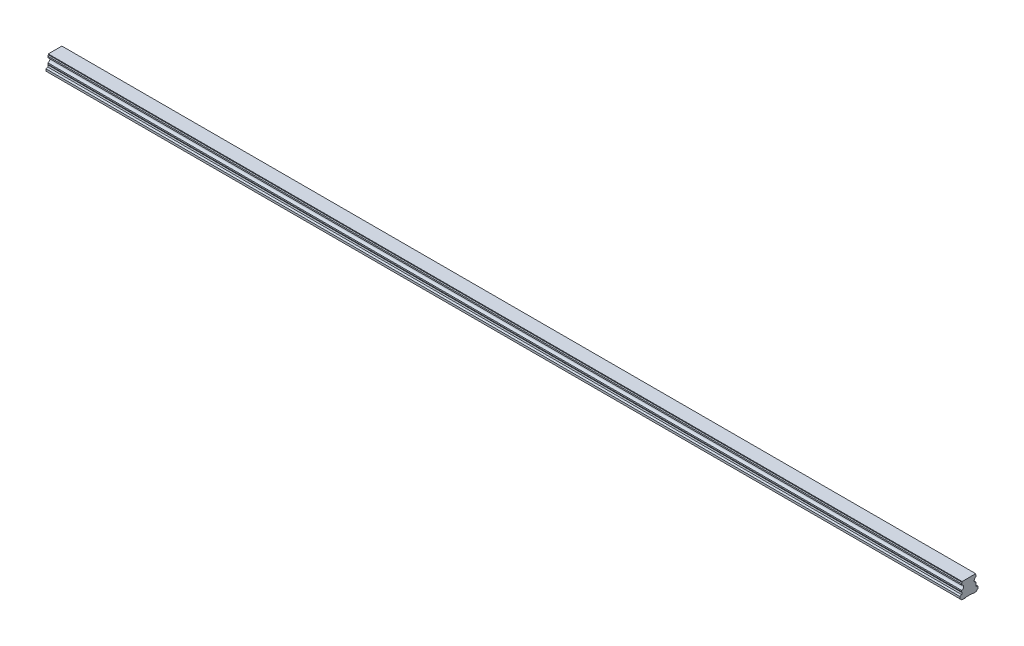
ISO-10303-21;
HEADER;
FILE_DESCRIPTION(('STEP AP214'),'2;1');
FILE_NAME('part.step','',(''),(''),'','','');
FILE_SCHEMA(('AUTOMOTIVE_DESIGN { 1 0 10303 214 1 1 1 1 }'));
ENDSEC;
DATA;
#1=APPLICATION_CONTEXT('core data for automotive mechanical design processes');
#2=APPLICATION_PROTOCOL_DEFINITION('international standard','automotive_design',2000,#1);
#3=PRODUCT_CONTEXT('',#1,'mechanical');
#4=PRODUCT('Part','Part','',(#3));
#5=PRODUCT_RELATED_PRODUCT_CATEGORY('part','',(#4));
#6=PRODUCT_DEFINITION_FORMATION('','',#4);
#7=PRODUCT_DEFINITION_CONTEXT('part definition',#1,'design');
#8=PRODUCT_DEFINITION('design','',#6,#7);
#9=PRODUCT_DEFINITION_SHAPE('','',#8);
#10=(LENGTH_UNIT() NAMED_UNIT(*) SI_UNIT(.MILLI.,.METRE.));
#11=(NAMED_UNIT(*) PLANE_ANGLE_UNIT() SI_UNIT($,.RADIAN.));
#12=(NAMED_UNIT(*) SI_UNIT($,.STERADIAN.) SOLID_ANGLE_UNIT());
#13=UNCERTAINTY_MEASURE_WITH_UNIT(LENGTH_MEASURE(1.E-05),#10,'distance_accuracy_value','');
#14=(GEOMETRIC_REPRESENTATION_CONTEXT(3) GLOBAL_UNCERTAINTY_ASSIGNED_CONTEXT((#13)) GLOBAL_UNIT_ASSIGNED_CONTEXT((#10,
#11,#12)) REPRESENTATION_CONTEXT('',''));
#15=CARTESIAN_POINT('',(0.,0.,0.));
#16=DIRECTION('',(0.,0.,1.));
#17=DIRECTION('',(1.,0.,0.));
#18=AXIS2_PLACEMENT_3D('',#15,#16,#17);
#19=CARTESIAN_POINT('',(1230.,0.499999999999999,0.));
#20=DIRECTION('',(0.,-1.,0.));
#21=DIRECTION('',(0.,0.,-1.));
#22=AXIS2_PLACEMENT_3D('',#19,#20,#21);
#23=CONICAL_SURFACE('',#22,3.5,0.785398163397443);
#24=CARTESIAN_POINT('',(1230.,1.00000000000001,0.));
#25=DIRECTION('',(0.,1.,0.));
#26=DIRECTION('',(0.,0.,1.));
#27=AXIS2_PLACEMENT_3D('',#24,#25,#26);
#28=CIRCLE('',#27,3.);
#29=CARTESIAN_POINT('',(1230.,1.00000000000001,3.));
#30=VERTEX_POINT('',#29);
#31=EDGE_CURVE('E11',#30,#30,#28,.F.);
#32=ORIENTED_EDGE('',*,*,#31,.F.);
#33=EDGE_LOOP('',(#32));
#34=FACE_BOUND('',#33,.T.);
#35=CARTESIAN_POINT('',(1230.,0.499999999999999,0.));
#36=DIRECTION('',(0.,1.,0.));
#37=DIRECTION('',(0.,0.,1.));
#38=AXIS2_PLACEMENT_3D('',#35,#36,#37);
#39=CIRCLE('',#38,3.5);
#40=CARTESIAN_POINT('',(1230.,0.5,3.5));
#41=VERTEX_POINT('',#40);
#42=EDGE_CURVE('E650',#41,#41,#39,.T.);
#43=ORIENTED_EDGE('',*,*,#42,.F.);
#44=EDGE_LOOP('',(#43));
#45=FACE_BOUND('',#44,.T.);
#46=ADVANCED_FACE('F39',(#34,#45),#23,.F.);
#47=CARTESIAN_POINT('',(1230.,12.,0.));
#48=DIRECTION('',(0.,-1.,0.));
#49=DIRECTION('',(0.,0.,-1.));
#50=AXIS2_PLACEMENT_3D('',#47,#48,#49);
#51=CYLINDRICAL_SURFACE('',#50,3.);
#52=ORIENTED_EDGE('',*,*,#31,.T.);
#53=EDGE_LOOP('',(#52));
#54=FACE_BOUND('',#53,.T.);
#55=CARTESIAN_POINT('',(1230.,12.,0.));
#56=DIRECTION('',(0.,-1.,0.));
#57=DIRECTION('',(0.,0.,-1.));
#58=AXIS2_PLACEMENT_3D('',#55,#56,#57);
#59=CIRCLE('',#58,3.);
#60=CARTESIAN_POINT('',(1230.,12.,-3.));
#61=VERTEX_POINT('',#60);
#62=EDGE_CURVE('E49',#61,#61,#59,.T.);
#63=ORIENTED_EDGE('',*,*,#62,.F.);
#64=EDGE_LOOP('',(#63));
#65=FACE_BOUND('',#64,.T.);
#66=ADVANCED_FACE('F917',(#54,#65),#51,.F.);
#67=CARTESIAN_POINT('',(1230.,12.,0.));
#68=DIRECTION('',(0.,-1.,0.));
#69=DIRECTION('',(0.,0.,-1.));
#70=AXIS2_PLACEMENT_3D('',#67,#68,#69);
#71=PLANE('',#70);
#72=CARTESIAN_POINT('',(1230.,12.,0.));
#73=DIRECTION('',(0.,-1.,0.));
#74=DIRECTION('',(0.,0.,-1.));
#75=AXIS2_PLACEMENT_3D('',#72,#73,#74);
#76=CIRCLE('',#75,2.5);
#77=CARTESIAN_POINT('',(1230.,12.,-2.5));
#78=VERTEX_POINT('',#77);
#79=EDGE_CURVE('E42',#78,#78,#76,.T.);
#80=ORIENTED_EDGE('',*,*,#79,.F.);
#81=EDGE_LOOP('',(#80));
#82=FACE_BOUND('',#81,.T.);
#83=ORIENTED_EDGE('',*,*,#62,.T.);
#84=EDGE_LOOP('',(#83));
#85=FACE_BOUND('',#84,.T.);
#86=ADVANCED_FACE('F922',(#82,#85),#71,.T.);
#87=CARTESIAN_POINT('',(1170.,0.499999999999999,0.));
#88=DIRECTION('',(0.,-1.,0.));
#89=DIRECTION('',(0.,0.,-1.));
#90=AXIS2_PLACEMENT_3D('',#87,#88,#89);
#91=CONICAL_SURFACE('',#90,3.5,0.785398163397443);
#92=CARTESIAN_POINT('',(1170.,1.00000000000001,0.));
#93=DIRECTION('',(0.,1.,0.));
#94=DIRECTION('',(0.,0.,1.));
#95=AXIS2_PLACEMENT_3D('',#92,#93,#94);
#96=CIRCLE('',#95,3.);
#97=CARTESIAN_POINT('',(1170.,1.00000000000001,3.));
#98=VERTEX_POINT('',#97);
#99=EDGE_CURVE('E646',#98,#98,#96,.F.);
#100=ORIENTED_EDGE('',*,*,#99,.F.);
#101=EDGE_LOOP('',(#100));
#102=FACE_BOUND('',#101,.T.);
#103=CARTESIAN_POINT('',(1170.,0.499999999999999,0.));
#104=DIRECTION('',(0.,1.,0.));
#105=DIRECTION('',(0.,0.,1.));
#106=AXIS2_PLACEMENT_3D('',#103,#104,#105);
#107=CIRCLE('',#106,3.5);
#108=CARTESIAN_POINT('',(1170.,0.5,3.5));
#109=VERTEX_POINT('',#108);
#110=EDGE_CURVE('E638',#109,#109,#107,.T.);
#111=ORIENTED_EDGE('',*,*,#110,.F.);
#112=EDGE_LOOP('',(#111));
#113=FACE_BOUND('',#112,.T.);
#114=ADVANCED_FACE('F1213',(#102,#113),#91,.F.);
#115=CARTESIAN_POINT('',(1170.,12.,0.));
#116=DIRECTION('',(0.,-1.,0.));
#117=DIRECTION('',(0.,0.,-1.));
#118=AXIS2_PLACEMENT_3D('',#115,#116,#117);
#119=CYLINDRICAL_SURFACE('',#118,3.);
#120=ORIENTED_EDGE('',*,*,#99,.T.);
#121=EDGE_LOOP('',(#120));
#122=FACE_BOUND('',#121,.T.);
#123=CARTESIAN_POINT('',(1170.,12.,0.));
#124=DIRECTION('',(0.,-1.,0.));
#125=DIRECTION('',(0.,0.,-1.));
#126=AXIS2_PLACEMENT_3D('',#123,#124,#125);
#127=CIRCLE('',#126,3.);
#128=CARTESIAN_POINT('',(1170.,12.,-3.));
#129=VERTEX_POINT('',#128);
#130=EDGE_CURVE('E642',#129,#129,#127,.T.);
#131=ORIENTED_EDGE('',*,*,#130,.F.);
#132=EDGE_LOOP('',(#131));
#133=FACE_BOUND('',#132,.T.);
#134=ADVANCED_FACE('F1209',(#122,#133),#119,.F.);
#135=CARTESIAN_POINT('',(1170.,12.,0.));
#136=DIRECTION('',(0.,-1.,0.));
#137=DIRECTION('',(0.,0.,-1.));
#138=AXIS2_PLACEMENT_3D('',#135,#136,#137);
#139=PLANE('',#138);
#140=CARTESIAN_POINT('',(1170.,12.,0.));
#141=DIRECTION('',(0.,-1.,0.));
#142=DIRECTION('',(0.,0.,-1.));
#143=AXIS2_PLACEMENT_3D('',#140,#141,#142);
#144=CIRCLE('',#143,2.5);
#145=CARTESIAN_POINT('',(1170.,12.,-2.5));
#146=VERTEX_POINT('',#145);
#147=EDGE_CURVE('E729',#146,#146,#144,.T.);
#148=ORIENTED_EDGE('',*,*,#147,.F.);
#149=EDGE_LOOP('',(#148));
#150=FACE_BOUND('',#149,.T.);
#151=ORIENTED_EDGE('',*,*,#130,.T.);
#152=EDGE_LOOP('',(#151));
#153=FACE_BOUND('',#152,.T.);
#154=ADVANCED_FACE('F1205',(#150,#153),#139,.T.);
#155=CARTESIAN_POINT('',(1110.,0.499999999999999,0.));
#156=DIRECTION('',(0.,-1.,0.));
#157=DIRECTION('',(0.,0.,-1.));
#158=AXIS2_PLACEMENT_3D('',#155,#156,#157);
#159=CONICAL_SURFACE('',#158,3.5,0.785398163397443);
#160=CARTESIAN_POINT('',(1110.,1.00000000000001,0.));
#161=DIRECTION('',(0.,1.,0.));
#162=DIRECTION('',(0.,0.,1.));
#163=AXIS2_PLACEMENT_3D('',#160,#161,#162);
#164=CIRCLE('',#163,3.);
#165=CARTESIAN_POINT('',(1110.,1.00000000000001,3.));
#166=VERTEX_POINT('',#165);
#167=EDGE_CURVE('E634',#166,#166,#164,.F.);
#168=ORIENTED_EDGE('',*,*,#167,.F.);
#169=EDGE_LOOP('',(#168));
#170=FACE_BOUND('',#169,.T.);
#171=CARTESIAN_POINT('',(1110.,0.499999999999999,0.));
#172=DIRECTION('',(0.,1.,0.));
#173=DIRECTION('',(0.,0.,1.));
#174=AXIS2_PLACEMENT_3D('',#171,#172,#173);
#175=CIRCLE('',#174,3.5);
#176=CARTESIAN_POINT('',(1110.,0.5,3.5));
#177=VERTEX_POINT('',#176);
#178=EDGE_CURVE('E626',#177,#177,#175,.T.);
#179=ORIENTED_EDGE('',*,*,#178,.F.);
#180=EDGE_LOOP('',(#179));
#181=FACE_BOUND('',#180,.T.);
#182=ADVANCED_FACE('F1201',(#170,#181),#159,.F.);
#183=CARTESIAN_POINT('',(1110.,12.,0.));
#184=DIRECTION('',(0.,-1.,0.));
#185=DIRECTION('',(0.,0.,-1.));
#186=AXIS2_PLACEMENT_3D('',#183,#184,#185);
#187=CYLINDRICAL_SURFACE('',#186,3.);
#188=ORIENTED_EDGE('',*,*,#167,.T.);
#189=EDGE_LOOP('',(#188));
#190=FACE_BOUND('',#189,.T.);
#191=CARTESIAN_POINT('',(1110.,12.,0.));
#192=DIRECTION('',(0.,-1.,0.));
#193=DIRECTION('',(0.,0.,-1.));
#194=AXIS2_PLACEMENT_3D('',#191,#192,#193);
#195=CIRCLE('',#194,3.);
#196=CARTESIAN_POINT('',(1110.,12.,-3.));
#197=VERTEX_POINT('',#196);
#198=EDGE_CURVE('E630',#197,#197,#195,.T.);
#199=ORIENTED_EDGE('',*,*,#198,.F.);
#200=EDGE_LOOP('',(#199));
#201=FACE_BOUND('',#200,.T.);
#202=ADVANCED_FACE('F1197',(#190,#201),#187,.F.);
#203=CARTESIAN_POINT('',(1110.,12.,0.));
#204=DIRECTION('',(0.,-1.,0.));
#205=DIRECTION('',(0.,0.,-1.));
#206=AXIS2_PLACEMENT_3D('',#203,#204,#205);
#207=PLANE('',#206);
#208=CARTESIAN_POINT('',(1110.,12.,0.));
#209=DIRECTION('',(0.,-1.,0.));
#210=DIRECTION('',(0.,0.,-1.));
#211=AXIS2_PLACEMENT_3D('',#208,#209,#210);
#212=CIRCLE('',#211,2.5);
#213=CARTESIAN_POINT('',(1110.,12.,-2.5));
#214=VERTEX_POINT('',#213);
#215=EDGE_CURVE('E726',#214,#214,#212,.T.);
#216=ORIENTED_EDGE('',*,*,#215,.F.);
#217=EDGE_LOOP('',(#216));
#218=FACE_BOUND('',#217,.T.);
#219=ORIENTED_EDGE('',*,*,#198,.T.);
#220=EDGE_LOOP('',(#219));
#221=FACE_BOUND('',#220,.T.);
#222=ADVANCED_FACE('F1193',(#218,#221),#207,.T.);
#223=CARTESIAN_POINT('',(1050.,0.499999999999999,0.));
#224=DIRECTION('',(0.,-1.,0.));
#225=DIRECTION('',(0.,0.,-1.));
#226=AXIS2_PLACEMENT_3D('',#223,#224,#225);
#227=CONICAL_SURFACE('',#226,3.5,0.785398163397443);
#228=CARTESIAN_POINT('',(1050.,1.00000000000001,0.));
#229=DIRECTION('',(0.,1.,0.));
#230=DIRECTION('',(0.,0.,1.));
#231=AXIS2_PLACEMENT_3D('',#228,#229,#230);
#232=CIRCLE('',#231,3.);
#233=CARTESIAN_POINT('',(1050.,1.00000000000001,3.));
#234=VERTEX_POINT('',#233);
#235=EDGE_CURVE('E622',#234,#234,#232,.F.);
#236=ORIENTED_EDGE('',*,*,#235,.F.);
#237=EDGE_LOOP('',(#236));
#238=FACE_BOUND('',#237,.T.);
#239=CARTESIAN_POINT('',(1050.,0.499999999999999,0.));
#240=DIRECTION('',(0.,1.,0.));
#241=DIRECTION('',(0.,0.,1.));
#242=AXIS2_PLACEMENT_3D('',#239,#240,#241);
#243=CIRCLE('',#242,3.5);
#244=CARTESIAN_POINT('',(1050.,0.5,3.5));
#245=VERTEX_POINT('',#244);
#246=EDGE_CURVE('E614',#245,#245,#243,.T.);
#247=ORIENTED_EDGE('',*,*,#246,.F.);
#248=EDGE_LOOP('',(#247));
#249=FACE_BOUND('',#248,.T.);
#250=ADVANCED_FACE('F1189',(#238,#249),#227,.F.);
#251=CARTESIAN_POINT('',(1050.,12.,0.));
#252=DIRECTION('',(0.,-1.,0.));
#253=DIRECTION('',(0.,0.,-1.));
#254=AXIS2_PLACEMENT_3D('',#251,#252,#253);
#255=CYLINDRICAL_SURFACE('',#254,3.);
#256=ORIENTED_EDGE('',*,*,#235,.T.);
#257=EDGE_LOOP('',(#256));
#258=FACE_BOUND('',#257,.T.);
#259=CARTESIAN_POINT('',(1050.,12.,0.));
#260=DIRECTION('',(0.,-1.,0.));
#261=DIRECTION('',(0.,0.,-1.));
#262=AXIS2_PLACEMENT_3D('',#259,#260,#261);
#263=CIRCLE('',#262,3.);
#264=CARTESIAN_POINT('',(1050.,12.,-3.));
#265=VERTEX_POINT('',#264);
#266=EDGE_CURVE('E618',#265,#265,#263,.T.);
#267=ORIENTED_EDGE('',*,*,#266,.F.);
#268=EDGE_LOOP('',(#267));
#269=FACE_BOUND('',#268,.T.);
#270=ADVANCED_FACE('F1185',(#258,#269),#255,.F.);
#271=CARTESIAN_POINT('',(1050.,12.,0.));
#272=DIRECTION('',(0.,-1.,0.));
#273=DIRECTION('',(0.,0.,-1.));
#274=AXIS2_PLACEMENT_3D('',#271,#272,#273);
#275=PLANE('',#274);
#276=CARTESIAN_POINT('',(1050.,12.,0.));
#277=DIRECTION('',(0.,-1.,0.));
#278=DIRECTION('',(0.,0.,-1.));
#279=AXIS2_PLACEMENT_3D('',#276,#277,#278);
#280=CIRCLE('',#279,2.5);
#281=CARTESIAN_POINT('',(1050.,12.,-2.5));
#282=VERTEX_POINT('',#281);
#283=EDGE_CURVE('E722',#282,#282,#280,.T.);
#284=ORIENTED_EDGE('',*,*,#283,.F.);
#285=EDGE_LOOP('',(#284));
#286=FACE_BOUND('',#285,.T.);
#287=ORIENTED_EDGE('',*,*,#266,.T.);
#288=EDGE_LOOP('',(#287));
#289=FACE_BOUND('',#288,.T.);
#290=ADVANCED_FACE('F1181',(#286,#289),#275,.T.);
#291=CARTESIAN_POINT('',(990.,0.499999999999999,0.));
#292=DIRECTION('',(0.,-1.,0.));
#293=DIRECTION('',(0.,0.,-1.));
#294=AXIS2_PLACEMENT_3D('',#291,#292,#293);
#295=CONICAL_SURFACE('',#294,3.5,0.785398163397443);
#296=CARTESIAN_POINT('',(990.,1.00000000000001,0.));
#297=DIRECTION('',(0.,1.,0.));
#298=DIRECTION('',(0.,0.,1.));
#299=AXIS2_PLACEMENT_3D('',#296,#297,#298);
#300=CIRCLE('',#299,3.);
#301=CARTESIAN_POINT('',(990.,1.00000000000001,3.));
#302=VERTEX_POINT('',#301);
#303=EDGE_CURVE('E610',#302,#302,#300,.F.);
#304=ORIENTED_EDGE('',*,*,#303,.F.);
#305=EDGE_LOOP('',(#304));
#306=FACE_BOUND('',#305,.T.);
#307=CARTESIAN_POINT('',(990.,0.499999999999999,0.));
#308=DIRECTION('',(0.,1.,0.));
#309=DIRECTION('',(0.,0.,1.));
#310=AXIS2_PLACEMENT_3D('',#307,#308,#309);
#311=CIRCLE('',#310,3.5);
#312=CARTESIAN_POINT('',(990.,0.5,3.5));
#313=VERTEX_POINT('',#312);
#314=EDGE_CURVE('E602',#313,#313,#311,.T.);
#315=ORIENTED_EDGE('',*,*,#314,.F.);
#316=EDGE_LOOP('',(#315));
#317=FACE_BOUND('',#316,.T.);
#318=ADVANCED_FACE('F1177',(#306,#317),#295,.F.);
#319=CARTESIAN_POINT('',(990.,12.,0.));
#320=DIRECTION('',(0.,-1.,0.));
#321=DIRECTION('',(0.,0.,-1.));
#322=AXIS2_PLACEMENT_3D('',#319,#320,#321);
#323=CYLINDRICAL_SURFACE('',#322,3.);
#324=ORIENTED_EDGE('',*,*,#303,.T.);
#325=EDGE_LOOP('',(#324));
#326=FACE_BOUND('',#325,.T.);
#327=CARTESIAN_POINT('',(990.,12.,0.));
#328=DIRECTION('',(0.,-1.,0.));
#329=DIRECTION('',(0.,0.,-1.));
#330=AXIS2_PLACEMENT_3D('',#327,#328,#329);
#331=CIRCLE('',#330,3.);
#332=CARTESIAN_POINT('',(990.,12.,-3.));
#333=VERTEX_POINT('',#332);
#334=EDGE_CURVE('E606',#333,#333,#331,.T.);
#335=ORIENTED_EDGE('',*,*,#334,.F.);
#336=EDGE_LOOP('',(#335));
#337=FACE_BOUND('',#336,.T.);
#338=ADVANCED_FACE('F1173',(#326,#337),#323,.F.);
#339=CARTESIAN_POINT('',(990.,12.,0.));
#340=DIRECTION('',(0.,-1.,0.));
#341=DIRECTION('',(0.,0.,-1.));
#342=AXIS2_PLACEMENT_3D('',#339,#340,#341);
#343=PLANE('',#342);
#344=CARTESIAN_POINT('',(990.,12.,0.));
#345=DIRECTION('',(0.,-1.,0.));
#346=DIRECTION('',(0.,0.,-1.));
#347=AXIS2_PLACEMENT_3D('',#344,#345,#346);
#348=CIRCLE('',#347,2.5);
#349=CARTESIAN_POINT('',(990.,12.,-2.5));
#350=VERTEX_POINT('',#349);
#351=EDGE_CURVE('E718',#350,#350,#348,.T.);
#352=ORIENTED_EDGE('',*,*,#351,.F.);
#353=EDGE_LOOP('',(#352));
#354=FACE_BOUND('',#353,.T.);
#355=ORIENTED_EDGE('',*,*,#334,.T.);
#356=EDGE_LOOP('',(#355));
#357=FACE_BOUND('',#356,.T.);
#358=ADVANCED_FACE('F1169',(#354,#357),#343,.T.);
#359=CARTESIAN_POINT('',(930.,0.499999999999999,0.));
#360=DIRECTION('',(0.,-1.,0.));
#361=DIRECTION('',(0.,0.,-1.));
#362=AXIS2_PLACEMENT_3D('',#359,#360,#361);
#363=CONICAL_SURFACE('',#362,3.5,0.785398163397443);
#364=CARTESIAN_POINT('',(930.,1.00000000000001,0.));
#365=DIRECTION('',(0.,1.,0.));
#366=DIRECTION('',(0.,0.,1.));
#367=AXIS2_PLACEMENT_3D('',#364,#365,#366);
#368=CIRCLE('',#367,3.);
#369=CARTESIAN_POINT('',(930.,1.00000000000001,3.));
#370=VERTEX_POINT('',#369);
#371=EDGE_CURVE('E598',#370,#370,#368,.F.);
#372=ORIENTED_EDGE('',*,*,#371,.F.);
#373=EDGE_LOOP('',(#372));
#374=FACE_BOUND('',#373,.T.);
#375=CARTESIAN_POINT('',(930.,0.499999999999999,0.));
#376=DIRECTION('',(0.,1.,0.));
#377=DIRECTION('',(0.,0.,1.));
#378=AXIS2_PLACEMENT_3D('',#375,#376,#377);
#379=CIRCLE('',#378,3.5);
#380=CARTESIAN_POINT('',(930.,0.5,3.5));
#381=VERTEX_POINT('',#380);
#382=EDGE_CURVE('E590',#381,#381,#379,.T.);
#383=ORIENTED_EDGE('',*,*,#382,.F.);
#384=EDGE_LOOP('',(#383));
#385=FACE_BOUND('',#384,.T.);
#386=ADVANCED_FACE('F1165',(#374,#385),#363,.F.);
#387=CARTESIAN_POINT('',(930.,12.,0.));
#388=DIRECTION('',(0.,-1.,0.));
#389=DIRECTION('',(0.,0.,-1.));
#390=AXIS2_PLACEMENT_3D('',#387,#388,#389);
#391=CYLINDRICAL_SURFACE('',#390,3.);
#392=ORIENTED_EDGE('',*,*,#371,.T.);
#393=EDGE_LOOP('',(#392));
#394=FACE_BOUND('',#393,.T.);
#395=CARTESIAN_POINT('',(930.,12.,0.));
#396=DIRECTION('',(0.,-1.,0.));
#397=DIRECTION('',(0.,0.,-1.));
#398=AXIS2_PLACEMENT_3D('',#395,#396,#397);
#399=CIRCLE('',#398,3.);
#400=CARTESIAN_POINT('',(930.,12.,-3.));
#401=VERTEX_POINT('',#400);
#402=EDGE_CURVE('E594',#401,#401,#399,.T.);
#403=ORIENTED_EDGE('',*,*,#402,.F.);
#404=EDGE_LOOP('',(#403));
#405=FACE_BOUND('',#404,.T.);
#406=ADVANCED_FACE('F1161',(#394,#405),#391,.F.);
#407=CARTESIAN_POINT('',(930.,12.,0.));
#408=DIRECTION('',(0.,-1.,0.));
#409=DIRECTION('',(0.,0.,-1.));
#410=AXIS2_PLACEMENT_3D('',#407,#408,#409);
#411=PLANE('',#410);
#412=CARTESIAN_POINT('',(930.,12.,0.));
#413=DIRECTION('',(0.,-1.,0.));
#414=DIRECTION('',(0.,0.,-1.));
#415=AXIS2_PLACEMENT_3D('',#412,#413,#414);
#416=CIRCLE('',#415,2.5);
#417=CARTESIAN_POINT('',(930.,12.,-2.5));
#418=VERTEX_POINT('',#417);
#419=EDGE_CURVE('E714',#418,#418,#416,.T.);
#420=ORIENTED_EDGE('',*,*,#419,.F.);
#421=EDGE_LOOP('',(#420));
#422=FACE_BOUND('',#421,.T.);
#423=ORIENTED_EDGE('',*,*,#402,.T.);
#424=EDGE_LOOP('',(#423));
#425=FACE_BOUND('',#424,.T.);
#426=ADVANCED_FACE('F1157',(#422,#425),#411,.T.);
#427=CARTESIAN_POINT('',(870.,0.499999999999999,0.));
#428=DIRECTION('',(0.,-1.,0.));
#429=DIRECTION('',(0.,0.,-1.));
#430=AXIS2_PLACEMENT_3D('',#427,#428,#429);
#431=CONICAL_SURFACE('',#430,3.5,0.785398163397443);
#432=CARTESIAN_POINT('',(870.,1.00000000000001,0.));
#433=DIRECTION('',(0.,1.,0.));
#434=DIRECTION('',(0.,0.,1.));
#435=AXIS2_PLACEMENT_3D('',#432,#433,#434);
#436=CIRCLE('',#435,3.);
#437=CARTESIAN_POINT('',(870.,1.00000000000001,3.));
#438=VERTEX_POINT('',#437);
#439=EDGE_CURVE('E586',#438,#438,#436,.F.);
#440=ORIENTED_EDGE('',*,*,#439,.F.);
#441=EDGE_LOOP('',(#440));
#442=FACE_BOUND('',#441,.T.);
#443=CARTESIAN_POINT('',(870.,0.499999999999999,0.));
#444=DIRECTION('',(0.,1.,0.));
#445=DIRECTION('',(0.,0.,1.));
#446=AXIS2_PLACEMENT_3D('',#443,#444,#445);
#447=CIRCLE('',#446,3.5);
#448=CARTESIAN_POINT('',(870.,0.5,3.5));
#449=VERTEX_POINT('',#448);
#450=EDGE_CURVE('E578',#449,#449,#447,.T.);
#451=ORIENTED_EDGE('',*,*,#450,.F.);
#452=EDGE_LOOP('',(#451));
#453=FACE_BOUND('',#452,.T.);
#454=ADVANCED_FACE('F1153',(#442,#453),#431,.F.);
#455=CARTESIAN_POINT('',(870.,12.,0.));
#456=DIRECTION('',(0.,-1.,0.));
#457=DIRECTION('',(0.,0.,-1.));
#458=AXIS2_PLACEMENT_3D('',#455,#456,#457);
#459=CYLINDRICAL_SURFACE('',#458,3.);
#460=ORIENTED_EDGE('',*,*,#439,.T.);
#461=EDGE_LOOP('',(#460));
#462=FACE_BOUND('',#461,.T.);
#463=CARTESIAN_POINT('',(870.,12.,0.));
#464=DIRECTION('',(0.,-1.,0.));
#465=DIRECTION('',(0.,0.,-1.));
#466=AXIS2_PLACEMENT_3D('',#463,#464,#465);
#467=CIRCLE('',#466,3.);
#468=CARTESIAN_POINT('',(870.,12.,-3.));
#469=VERTEX_POINT('',#468);
#470=EDGE_CURVE('E582',#469,#469,#467,.T.);
#471=ORIENTED_EDGE('',*,*,#470,.F.);
#472=EDGE_LOOP('',(#471));
#473=FACE_BOUND('',#472,.T.);
#474=ADVANCED_FACE('F1149',(#462,#473),#459,.F.);
#475=CARTESIAN_POINT('',(870.,12.,0.));
#476=DIRECTION('',(0.,-1.,0.));
#477=DIRECTION('',(0.,0.,-1.));
#478=AXIS2_PLACEMENT_3D('',#475,#476,#477);
#479=PLANE('',#478);
#480=CARTESIAN_POINT('',(870.,12.,0.));
#481=DIRECTION('',(0.,-1.,0.));
#482=DIRECTION('',(0.,0.,-1.));
#483=AXIS2_PLACEMENT_3D('',#480,#481,#482);
#484=CIRCLE('',#483,2.5);
#485=CARTESIAN_POINT('',(870.,12.,-2.5));
#486=VERTEX_POINT('',#485);
#487=EDGE_CURVE('E710',#486,#486,#484,.T.);
#488=ORIENTED_EDGE('',*,*,#487,.F.);
#489=EDGE_LOOP('',(#488));
#490=FACE_BOUND('',#489,.T.);
#491=ORIENTED_EDGE('',*,*,#470,.T.);
#492=EDGE_LOOP('',(#491));
#493=FACE_BOUND('',#492,.T.);
#494=ADVANCED_FACE('F1145',(#490,#493),#479,.T.);
#495=CARTESIAN_POINT('',(810.,0.499999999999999,0.));
#496=DIRECTION('',(0.,-1.,0.));
#497=DIRECTION('',(0.,0.,-1.));
#498=AXIS2_PLACEMENT_3D('',#495,#496,#497);
#499=CONICAL_SURFACE('',#498,3.5,0.785398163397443);
#500=CARTESIAN_POINT('',(810.,1.00000000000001,0.));
#501=DIRECTION('',(0.,1.,0.));
#502=DIRECTION('',(0.,0.,1.));
#503=AXIS2_PLACEMENT_3D('',#500,#501,#502);
#504=CIRCLE('',#503,3.);
#505=CARTESIAN_POINT('',(810.,1.00000000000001,3.));
#506=VERTEX_POINT('',#505);
#507=EDGE_CURVE('E574',#506,#506,#504,.F.);
#508=ORIENTED_EDGE('',*,*,#507,.F.);
#509=EDGE_LOOP('',(#508));
#510=FACE_BOUND('',#509,.T.);
#511=CARTESIAN_POINT('',(810.,0.499999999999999,0.));
#512=DIRECTION('',(0.,1.,0.));
#513=DIRECTION('',(0.,0.,1.));
#514=AXIS2_PLACEMENT_3D('',#511,#512,#513);
#515=CIRCLE('',#514,3.5);
#516=CARTESIAN_POINT('',(810.,0.5,3.5));
#517=VERTEX_POINT('',#516);
#518=EDGE_CURVE('E566',#517,#517,#515,.T.);
#519=ORIENTED_EDGE('',*,*,#518,.F.);
#520=EDGE_LOOP('',(#519));
#521=FACE_BOUND('',#520,.T.);
#522=ADVANCED_FACE('F1141',(#510,#521),#499,.F.);
#523=CARTESIAN_POINT('',(810.,12.,0.));
#524=DIRECTION('',(0.,-1.,0.));
#525=DIRECTION('',(0.,0.,-1.));
#526=AXIS2_PLACEMENT_3D('',#523,#524,#525);
#527=CYLINDRICAL_SURFACE('',#526,3.);
#528=ORIENTED_EDGE('',*,*,#507,.T.);
#529=EDGE_LOOP('',(#528));
#530=FACE_BOUND('',#529,.T.);
#531=CARTESIAN_POINT('',(810.,12.,0.));
#532=DIRECTION('',(0.,-1.,0.));
#533=DIRECTION('',(0.,0.,-1.));
#534=AXIS2_PLACEMENT_3D('',#531,#532,#533);
#535=CIRCLE('',#534,3.);
#536=CARTESIAN_POINT('',(810.,12.,-3.));
#537=VERTEX_POINT('',#536);
#538=EDGE_CURVE('E570',#537,#537,#535,.T.);
#539=ORIENTED_EDGE('',*,*,#538,.F.);
#540=EDGE_LOOP('',(#539));
#541=FACE_BOUND('',#540,.T.);
#542=ADVANCED_FACE('F1137',(#530,#541),#527,.F.);
#543=CARTESIAN_POINT('',(810.,12.,0.));
#544=DIRECTION('',(0.,-1.,0.));
#545=DIRECTION('',(0.,0.,-1.));
#546=AXIS2_PLACEMENT_3D('',#543,#544,#545);
#547=PLANE('',#546);
#548=CARTESIAN_POINT('',(810.,12.,0.));
#549=DIRECTION('',(0.,-1.,0.));
#550=DIRECTION('',(0.,0.,-1.));
#551=AXIS2_PLACEMENT_3D('',#548,#549,#550);
#552=CIRCLE('',#551,2.5);
#553=CARTESIAN_POINT('',(810.,12.,-2.5));
#554=VERTEX_POINT('',#553);
#555=EDGE_CURVE('E706',#554,#554,#552,.T.);
#556=ORIENTED_EDGE('',*,*,#555,.F.);
#557=EDGE_LOOP('',(#556));
#558=FACE_BOUND('',#557,.T.);
#559=ORIENTED_EDGE('',*,*,#538,.T.);
#560=EDGE_LOOP('',(#559));
#561=FACE_BOUND('',#560,.T.);
#562=ADVANCED_FACE('F1133',(#558,#561),#547,.T.);
#563=CARTESIAN_POINT('',(750.,0.499999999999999,0.));
#564=DIRECTION('',(0.,-1.,0.));
#565=DIRECTION('',(0.,0.,-1.));
#566=AXIS2_PLACEMENT_3D('',#563,#564,#565);
#567=CONICAL_SURFACE('',#566,3.5,0.785398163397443);
#568=CARTESIAN_POINT('',(750.,1.00000000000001,0.));
#569=DIRECTION('',(0.,1.,0.));
#570=DIRECTION('',(0.,0.,1.));
#571=AXIS2_PLACEMENT_3D('',#568,#569,#570);
#572=CIRCLE('',#571,3.);
#573=CARTESIAN_POINT('',(750.,1.00000000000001,3.));
#574=VERTEX_POINT('',#573);
#575=EDGE_CURVE('E562',#574,#574,#572,.F.);
#576=ORIENTED_EDGE('',*,*,#575,.F.);
#577=EDGE_LOOP('',(#576));
#578=FACE_BOUND('',#577,.T.);
#579=CARTESIAN_POINT('',(750.,0.499999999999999,0.));
#580=DIRECTION('',(0.,1.,0.));
#581=DIRECTION('',(0.,0.,1.));
#582=AXIS2_PLACEMENT_3D('',#579,#580,#581);
#583=CIRCLE('',#582,3.5);
#584=CARTESIAN_POINT('',(750.,0.5,3.5));
#585=VERTEX_POINT('',#584);
#586=EDGE_CURVE('E554',#585,#585,#583,.T.);
#587=ORIENTED_EDGE('',*,*,#586,.F.);
#588=EDGE_LOOP('',(#587));
#589=FACE_BOUND('',#588,.T.);
#590=ADVANCED_FACE('F1129',(#578,#589),#567,.F.);
#591=CARTESIAN_POINT('',(750.,12.,0.));
#592=DIRECTION('',(0.,-1.,0.));
#593=DIRECTION('',(0.,0.,-1.));
#594=AXIS2_PLACEMENT_3D('',#591,#592,#593);
#595=CYLINDRICAL_SURFACE('',#594,3.);
#596=ORIENTED_EDGE('',*,*,#575,.T.);
#597=EDGE_LOOP('',(#596));
#598=FACE_BOUND('',#597,.T.);
#599=CARTESIAN_POINT('',(750.,12.,0.));
#600=DIRECTION('',(0.,-1.,0.));
#601=DIRECTION('',(0.,0.,-1.));
#602=AXIS2_PLACEMENT_3D('',#599,#600,#601);
#603=CIRCLE('',#602,3.);
#604=CARTESIAN_POINT('',(750.,12.,-3.));
#605=VERTEX_POINT('',#604);
#606=EDGE_CURVE('E558',#605,#605,#603,.T.);
#607=ORIENTED_EDGE('',*,*,#606,.F.);
#608=EDGE_LOOP('',(#607));
#609=FACE_BOUND('',#608,.T.);
#610=ADVANCED_FACE('F1125',(#598,#609),#595,.F.);
#611=CARTESIAN_POINT('',(750.,12.,0.));
#612=DIRECTION('',(0.,-1.,0.));
#613=DIRECTION('',(0.,0.,-1.));
#614=AXIS2_PLACEMENT_3D('',#611,#612,#613);
#615=PLANE('',#614);
#616=CARTESIAN_POINT('',(750.,12.,0.));
#617=DIRECTION('',(0.,-1.,0.));
#618=DIRECTION('',(0.,0.,-1.));
#619=AXIS2_PLACEMENT_3D('',#616,#617,#618);
#620=CIRCLE('',#619,2.5);
#621=CARTESIAN_POINT('',(750.,12.,-2.5));
#622=VERTEX_POINT('',#621);
#623=EDGE_CURVE('E702',#622,#622,#620,.T.);
#624=ORIENTED_EDGE('',*,*,#623,.F.);
#625=EDGE_LOOP('',(#624));
#626=FACE_BOUND('',#625,.T.);
#627=ORIENTED_EDGE('',*,*,#606,.T.);
#628=EDGE_LOOP('',(#627));
#629=FACE_BOUND('',#628,.T.);
#630=ADVANCED_FACE('F1121',(#626,#629),#615,.T.);
#631=CARTESIAN_POINT('',(690.,0.499999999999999,0.));
#632=DIRECTION('',(0.,-1.,0.));
#633=DIRECTION('',(0.,0.,-1.));
#634=AXIS2_PLACEMENT_3D('',#631,#632,#633);
#635=CONICAL_SURFACE('',#634,3.5,0.785398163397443);
#636=CARTESIAN_POINT('',(690.,1.00000000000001,0.));
#637=DIRECTION('',(0.,1.,0.));
#638=DIRECTION('',(0.,0.,1.));
#639=AXIS2_PLACEMENT_3D('',#636,#637,#638);
#640=CIRCLE('',#639,3.);
#641=CARTESIAN_POINT('',(690.,1.00000000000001,3.));
#642=VERTEX_POINT('',#641);
#643=EDGE_CURVE('E550',#642,#642,#640,.F.);
#644=ORIENTED_EDGE('',*,*,#643,.F.);
#645=EDGE_LOOP('',(#644));
#646=FACE_BOUND('',#645,.T.);
#647=CARTESIAN_POINT('',(690.,0.499999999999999,0.));
#648=DIRECTION('',(0.,1.,0.));
#649=DIRECTION('',(0.,0.,1.));
#650=AXIS2_PLACEMENT_3D('',#647,#648,#649);
#651=CIRCLE('',#650,3.5);
#652=CARTESIAN_POINT('',(690.,0.5,3.5));
#653=VERTEX_POINT('',#652);
#654=EDGE_CURVE('E542',#653,#653,#651,.T.);
#655=ORIENTED_EDGE('',*,*,#654,.F.);
#656=EDGE_LOOP('',(#655));
#657=FACE_BOUND('',#656,.T.);
#658=ADVANCED_FACE('F1117',(#646,#657),#635,.F.);
#659=CARTESIAN_POINT('',(690.,12.,0.));
#660=DIRECTION('',(0.,-1.,0.));
#661=DIRECTION('',(0.,0.,-1.));
#662=AXIS2_PLACEMENT_3D('',#659,#660,#661);
#663=CYLINDRICAL_SURFACE('',#662,3.);
#664=ORIENTED_EDGE('',*,*,#643,.T.);
#665=EDGE_LOOP('',(#664));
#666=FACE_BOUND('',#665,.T.);
#667=CARTESIAN_POINT('',(690.,12.,0.));
#668=DIRECTION('',(0.,-1.,0.));
#669=DIRECTION('',(0.,0.,-1.));
#670=AXIS2_PLACEMENT_3D('',#667,#668,#669);
#671=CIRCLE('',#670,3.);
#672=CARTESIAN_POINT('',(690.,12.,-3.));
#673=VERTEX_POINT('',#672);
#674=EDGE_CURVE('E546',#673,#673,#671,.T.);
#675=ORIENTED_EDGE('',*,*,#674,.F.);
#676=EDGE_LOOP('',(#675));
#677=FACE_BOUND('',#676,.T.);
#678=ADVANCED_FACE('F1113',(#666,#677),#663,.F.);
#679=CARTESIAN_POINT('',(690.,12.,0.));
#680=DIRECTION('',(0.,-1.,0.));
#681=DIRECTION('',(0.,0.,-1.));
#682=AXIS2_PLACEMENT_3D('',#679,#680,#681);
#683=PLANE('',#682);
#684=CARTESIAN_POINT('',(690.,12.,0.));
#685=DIRECTION('',(0.,-1.,0.));
#686=DIRECTION('',(0.,0.,-1.));
#687=AXIS2_PLACEMENT_3D('',#684,#685,#686);
#688=CIRCLE('',#687,2.5);
#689=CARTESIAN_POINT('',(690.,12.,-2.5));
#690=VERTEX_POINT('',#689);
#691=EDGE_CURVE('E698',#690,#690,#688,.T.);
#692=ORIENTED_EDGE('',*,*,#691,.F.);
#693=EDGE_LOOP('',(#692));
#694=FACE_BOUND('',#693,.T.);
#695=ORIENTED_EDGE('',*,*,#674,.T.);
#696=EDGE_LOOP('',(#695));
#697=FACE_BOUND('',#696,.T.);
#698=ADVANCED_FACE('F1109',(#694,#697),#683,.T.);
#699=CARTESIAN_POINT('',(630.,0.499999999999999,0.));
#700=DIRECTION('',(0.,-1.,0.));
#701=DIRECTION('',(0.,0.,-1.));
#702=AXIS2_PLACEMENT_3D('',#699,#700,#701);
#703=CONICAL_SURFACE('',#702,3.5,0.785398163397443);
#704=CARTESIAN_POINT('',(630.,1.00000000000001,0.));
#705=DIRECTION('',(0.,1.,0.));
#706=DIRECTION('',(0.,0.,1.));
#707=AXIS2_PLACEMENT_3D('',#704,#705,#706);
#708=CIRCLE('',#707,3.);
#709=CARTESIAN_POINT('',(630.,1.00000000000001,3.));
#710=VERTEX_POINT('',#709);
#711=EDGE_CURVE('E538',#710,#710,#708,.F.);
#712=ORIENTED_EDGE('',*,*,#711,.F.);
#713=EDGE_LOOP('',(#712));
#714=FACE_BOUND('',#713,.T.);
#715=CARTESIAN_POINT('',(630.,0.499999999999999,0.));
#716=DIRECTION('',(0.,1.,0.));
#717=DIRECTION('',(0.,0.,1.));
#718=AXIS2_PLACEMENT_3D('',#715,#716,#717);
#719=CIRCLE('',#718,3.5);
#720=CARTESIAN_POINT('',(630.,0.5,3.5));
#721=VERTEX_POINT('',#720);
#722=EDGE_CURVE('E530',#721,#721,#719,.T.);
#723=ORIENTED_EDGE('',*,*,#722,.F.);
#724=EDGE_LOOP('',(#723));
#725=FACE_BOUND('',#724,.T.);
#726=ADVANCED_FACE('F1105',(#714,#725),#703,.F.);
#727=CARTESIAN_POINT('',(630.,12.,0.));
#728=DIRECTION('',(0.,-1.,0.));
#729=DIRECTION('',(0.,0.,-1.));
#730=AXIS2_PLACEMENT_3D('',#727,#728,#729);
#731=CYLINDRICAL_SURFACE('',#730,3.);
#732=ORIENTED_EDGE('',*,*,#711,.T.);
#733=EDGE_LOOP('',(#732));
#734=FACE_BOUND('',#733,.T.);
#735=CARTESIAN_POINT('',(630.,12.,0.));
#736=DIRECTION('',(0.,-1.,0.));
#737=DIRECTION('',(0.,0.,-1.));
#738=AXIS2_PLACEMENT_3D('',#735,#736,#737);
#739=CIRCLE('',#738,3.);
#740=CARTESIAN_POINT('',(630.,12.,-3.));
#741=VERTEX_POINT('',#740);
#742=EDGE_CURVE('E534',#741,#741,#739,.T.);
#743=ORIENTED_EDGE('',*,*,#742,.F.);
#744=EDGE_LOOP('',(#743));
#745=FACE_BOUND('',#744,.T.);
#746=ADVANCED_FACE('F1101',(#734,#745),#731,.F.);
#747=CARTESIAN_POINT('',(630.,12.,0.));
#748=DIRECTION('',(0.,-1.,0.));
#749=DIRECTION('',(0.,0.,-1.));
#750=AXIS2_PLACEMENT_3D('',#747,#748,#749);
#751=PLANE('',#750);
#752=CARTESIAN_POINT('',(630.,12.,0.));
#753=DIRECTION('',(0.,-1.,0.));
#754=DIRECTION('',(0.,0.,-1.));
#755=AXIS2_PLACEMENT_3D('',#752,#753,#754);
#756=CIRCLE('',#755,2.5);
#757=CARTESIAN_POINT('',(630.,12.,-2.5));
#758=VERTEX_POINT('',#757);
#759=EDGE_CURVE('E694',#758,#758,#756,.T.);
#760=ORIENTED_EDGE('',*,*,#759,.F.);
#761=EDGE_LOOP('',(#760));
#762=FACE_BOUND('',#761,.T.);
#763=ORIENTED_EDGE('',*,*,#742,.T.);
#764=EDGE_LOOP('',(#763));
#765=FACE_BOUND('',#764,.T.);
#766=ADVANCED_FACE('F1097',(#762,#765),#751,.T.);
#767=CARTESIAN_POINT('',(570.,0.499999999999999,0.));
#768=DIRECTION('',(0.,-1.,0.));
#769=DIRECTION('',(0.,0.,-1.));
#770=AXIS2_PLACEMENT_3D('',#767,#768,#769);
#771=CONICAL_SURFACE('',#770,3.5,0.785398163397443);
#772=CARTESIAN_POINT('',(570.,1.00000000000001,0.));
#773=DIRECTION('',(0.,1.,0.));
#774=DIRECTION('',(0.,0.,1.));
#775=AXIS2_PLACEMENT_3D('',#772,#773,#774);
#776=CIRCLE('',#775,3.);
#777=CARTESIAN_POINT('',(570.,1.00000000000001,3.));
#778=VERTEX_POINT('',#777);
#779=EDGE_CURVE('E526',#778,#778,#776,.F.);
#780=ORIENTED_EDGE('',*,*,#779,.F.);
#781=EDGE_LOOP('',(#780));
#782=FACE_BOUND('',#781,.T.);
#783=CARTESIAN_POINT('',(570.,0.499999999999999,0.));
#784=DIRECTION('',(0.,1.,0.));
#785=DIRECTION('',(0.,0.,1.));
#786=AXIS2_PLACEMENT_3D('',#783,#784,#785);
#787=CIRCLE('',#786,3.5);
#788=CARTESIAN_POINT('',(570.,0.5,3.5));
#789=VERTEX_POINT('',#788);
#790=EDGE_CURVE('E518',#789,#789,#787,.T.);
#791=ORIENTED_EDGE('',*,*,#790,.F.);
#792=EDGE_LOOP('',(#791));
#793=FACE_BOUND('',#792,.T.);
#794=ADVANCED_FACE('F1093',(#782,#793),#771,.F.);
#795=CARTESIAN_POINT('',(570.,12.,0.));
#796=DIRECTION('',(0.,-1.,0.));
#797=DIRECTION('',(0.,0.,-1.));
#798=AXIS2_PLACEMENT_3D('',#795,#796,#797);
#799=CYLINDRICAL_SURFACE('',#798,3.);
#800=ORIENTED_EDGE('',*,*,#779,.T.);
#801=EDGE_LOOP('',(#800));
#802=FACE_BOUND('',#801,.T.);
#803=CARTESIAN_POINT('',(570.,12.,0.));
#804=DIRECTION('',(0.,-1.,0.));
#805=DIRECTION('',(0.,0.,-1.));
#806=AXIS2_PLACEMENT_3D('',#803,#804,#805);
#807=CIRCLE('',#806,3.);
#808=CARTESIAN_POINT('',(570.,12.,-3.));
#809=VERTEX_POINT('',#808);
#810=EDGE_CURVE('E522',#809,#809,#807,.T.);
#811=ORIENTED_EDGE('',*,*,#810,.F.);
#812=EDGE_LOOP('',(#811));
#813=FACE_BOUND('',#812,.T.);
#814=ADVANCED_FACE('F1089',(#802,#813),#799,.F.);
#815=CARTESIAN_POINT('',(570.,12.,0.));
#816=DIRECTION('',(0.,-1.,0.));
#817=DIRECTION('',(0.,0.,-1.));
#818=AXIS2_PLACEMENT_3D('',#815,#816,#817);
#819=PLANE('',#818);
#820=CARTESIAN_POINT('',(570.,12.,0.));
#821=DIRECTION('',(0.,-1.,0.));
#822=DIRECTION('',(0.,0.,-1.));
#823=AXIS2_PLACEMENT_3D('',#820,#821,#822);
#824=CIRCLE('',#823,2.5);
#825=CARTESIAN_POINT('',(570.,12.,-2.5));
#826=VERTEX_POINT('',#825);
#827=EDGE_CURVE('E690',#826,#826,#824,.T.);
#828=ORIENTED_EDGE('',*,*,#827,.F.);
#829=EDGE_LOOP('',(#828));
#830=FACE_BOUND('',#829,.T.);
#831=ORIENTED_EDGE('',*,*,#810,.T.);
#832=EDGE_LOOP('',(#831));
#833=FACE_BOUND('',#832,.T.);
#834=ADVANCED_FACE('F1085',(#830,#833),#819,.T.);
#835=CARTESIAN_POINT('',(510.,0.499999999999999,0.));
#836=DIRECTION('',(0.,-1.,0.));
#837=DIRECTION('',(0.,0.,-1.));
#838=AXIS2_PLACEMENT_3D('',#835,#836,#837);
#839=CONICAL_SURFACE('',#838,3.5,0.785398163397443);
#840=CARTESIAN_POINT('',(510.,1.00000000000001,0.));
#841=DIRECTION('',(0.,1.,0.));
#842=DIRECTION('',(0.,0.,1.));
#843=AXIS2_PLACEMENT_3D('',#840,#841,#842);
#844=CIRCLE('',#843,3.);
#845=CARTESIAN_POINT('',(510.,1.00000000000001,3.));
#846=VERTEX_POINT('',#845);
#847=EDGE_CURVE('E514',#846,#846,#844,.F.);
#848=ORIENTED_EDGE('',*,*,#847,.F.);
#849=EDGE_LOOP('',(#848));
#850=FACE_BOUND('',#849,.T.);
#851=CARTESIAN_POINT('',(510.,0.499999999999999,0.));
#852=DIRECTION('',(0.,1.,0.));
#853=DIRECTION('',(0.,0.,1.));
#854=AXIS2_PLACEMENT_3D('',#851,#852,#853);
#855=CIRCLE('',#854,3.5);
#856=CARTESIAN_POINT('',(510.,0.5,3.5));
#857=VERTEX_POINT('',#856);
#858=EDGE_CURVE('E506',#857,#857,#855,.T.);
#859=ORIENTED_EDGE('',*,*,#858,.F.);
#860=EDGE_LOOP('',(#859));
#861=FACE_BOUND('',#860,.T.);
#862=ADVANCED_FACE('F1081',(#850,#861),#839,.F.);
#863=CARTESIAN_POINT('',(510.,12.,0.));
#864=DIRECTION('',(0.,-1.,0.));
#865=DIRECTION('',(0.,0.,-1.));
#866=AXIS2_PLACEMENT_3D('',#863,#864,#865);
#867=CYLINDRICAL_SURFACE('',#866,3.);
#868=ORIENTED_EDGE('',*,*,#847,.T.);
#869=EDGE_LOOP('',(#868));
#870=FACE_BOUND('',#869,.T.);
#871=CARTESIAN_POINT('',(510.,12.,0.));
#872=DIRECTION('',(0.,-1.,0.));
#873=DIRECTION('',(0.,0.,-1.));
#874=AXIS2_PLACEMENT_3D('',#871,#872,#873);
#875=CIRCLE('',#874,3.);
#876=CARTESIAN_POINT('',(510.,12.,-3.));
#877=VERTEX_POINT('',#876);
#878=EDGE_CURVE('E510',#877,#877,#875,.T.);
#879=ORIENTED_EDGE('',*,*,#878,.F.);
#880=EDGE_LOOP('',(#879));
#881=FACE_BOUND('',#880,.T.);
#882=ADVANCED_FACE('F1077',(#870,#881),#867,.F.);
#883=CARTESIAN_POINT('',(510.,12.,0.));
#884=DIRECTION('',(0.,-1.,0.));
#885=DIRECTION('',(0.,0.,-1.));
#886=AXIS2_PLACEMENT_3D('',#883,#884,#885);
#887=PLANE('',#886);
#888=CARTESIAN_POINT('',(510.,12.,0.));
#889=DIRECTION('',(0.,-1.,0.));
#890=DIRECTION('',(0.,0.,-1.));
#891=AXIS2_PLACEMENT_3D('',#888,#889,#890);
#892=CIRCLE('',#891,2.5);
#893=CARTESIAN_POINT('',(510.,12.,-2.5));
#894=VERTEX_POINT('',#893);
#895=EDGE_CURVE('E686',#894,#894,#892,.T.);
#896=ORIENTED_EDGE('',*,*,#895,.F.);
#897=EDGE_LOOP('',(#896));
#898=FACE_BOUND('',#897,.T.);
#899=ORIENTED_EDGE('',*,*,#878,.T.);
#900=EDGE_LOOP('',(#899));
#901=FACE_BOUND('',#900,.T.);
#902=ADVANCED_FACE('F1073',(#898,#901),#887,.T.);
#903=CARTESIAN_POINT('',(450.,0.499999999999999,0.));
#904=DIRECTION('',(0.,-1.,0.));
#905=DIRECTION('',(0.,0.,-1.));
#906=AXIS2_PLACEMENT_3D('',#903,#904,#905);
#907=CONICAL_SURFACE('',#906,3.5,0.785398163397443);
#908=CARTESIAN_POINT('',(450.,1.00000000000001,0.));
#909=DIRECTION('',(0.,1.,0.));
#910=DIRECTION('',(0.,0.,1.));
#911=AXIS2_PLACEMENT_3D('',#908,#909,#910);
#912=CIRCLE('',#911,3.);
#913=CARTESIAN_POINT('',(450.,1.00000000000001,3.));
#914=VERTEX_POINT('',#913);
#915=EDGE_CURVE('E502',#914,#914,#912,.F.);
#916=ORIENTED_EDGE('',*,*,#915,.F.);
#917=EDGE_LOOP('',(#916));
#918=FACE_BOUND('',#917,.T.);
#919=CARTESIAN_POINT('',(450.,0.499999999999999,0.));
#920=DIRECTION('',(0.,1.,0.));
#921=DIRECTION('',(0.,0.,1.));
#922=AXIS2_PLACEMENT_3D('',#919,#920,#921);
#923=CIRCLE('',#922,3.5);
#924=CARTESIAN_POINT('',(450.,0.5,3.5));
#925=VERTEX_POINT('',#924);
#926=EDGE_CURVE('E494',#925,#925,#923,.T.);
#927=ORIENTED_EDGE('',*,*,#926,.F.);
#928=EDGE_LOOP('',(#927));
#929=FACE_BOUND('',#928,.T.);
#930=ADVANCED_FACE('F1069',(#918,#929),#907,.F.);
#931=CARTESIAN_POINT('',(450.,12.,0.));
#932=DIRECTION('',(0.,-1.,0.));
#933=DIRECTION('',(0.,0.,-1.));
#934=AXIS2_PLACEMENT_3D('',#931,#932,#933);
#935=CYLINDRICAL_SURFACE('',#934,3.);
#936=ORIENTED_EDGE('',*,*,#915,.T.);
#937=EDGE_LOOP('',(#936));
#938=FACE_BOUND('',#937,.T.);
#939=CARTESIAN_POINT('',(450.,12.,0.));
#940=DIRECTION('',(0.,-1.,0.));
#941=DIRECTION('',(0.,0.,-1.));
#942=AXIS2_PLACEMENT_3D('',#939,#940,#941);
#943=CIRCLE('',#942,3.);
#944=CARTESIAN_POINT('',(450.,12.,-3.));
#945=VERTEX_POINT('',#944);
#946=EDGE_CURVE('E498',#945,#945,#943,.T.);
#947=ORIENTED_EDGE('',*,*,#946,.F.);
#948=EDGE_LOOP('',(#947));
#949=FACE_BOUND('',#948,.T.);
#950=ADVANCED_FACE('F1065',(#938,#949),#935,.F.);
#951=CARTESIAN_POINT('',(450.,12.,0.));
#952=DIRECTION('',(0.,-1.,0.));
#953=DIRECTION('',(0.,0.,-1.));
#954=AXIS2_PLACEMENT_3D('',#951,#952,#953);
#955=PLANE('',#954);
#956=CARTESIAN_POINT('',(450.,12.,0.));
#957=DIRECTION('',(0.,-1.,0.));
#958=DIRECTION('',(0.,0.,-1.));
#959=AXIS2_PLACEMENT_3D('',#956,#957,#958);
#960=CIRCLE('',#959,2.5);
#961=CARTESIAN_POINT('',(450.,12.,-2.5));
#962=VERTEX_POINT('',#961);
#963=EDGE_CURVE('E682',#962,#962,#960,.T.);
#964=ORIENTED_EDGE('',*,*,#963,.F.);
#965=EDGE_LOOP('',(#964));
#966=FACE_BOUND('',#965,.T.);
#967=ORIENTED_EDGE('',*,*,#946,.T.);
#968=EDGE_LOOP('',(#967));
#969=FACE_BOUND('',#968,.T.);
#970=ADVANCED_FACE('F1061',(#966,#969),#955,.T.);
#971=CARTESIAN_POINT('',(390.,0.499999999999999,0.));
#972=DIRECTION('',(0.,-1.,0.));
#973=DIRECTION('',(0.,0.,-1.));
#974=AXIS2_PLACEMENT_3D('',#971,#972,#973);
#975=CONICAL_SURFACE('',#974,3.5,0.785398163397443);
#976=CARTESIAN_POINT('',(390.,1.00000000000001,0.));
#977=DIRECTION('',(0.,1.,0.));
#978=DIRECTION('',(0.,0.,1.));
#979=AXIS2_PLACEMENT_3D('',#976,#977,#978);
#980=CIRCLE('',#979,3.);
#981=CARTESIAN_POINT('',(390.,1.00000000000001,3.));
#982=VERTEX_POINT('',#981);
#983=EDGE_CURVE('E490',#982,#982,#980,.F.);
#984=ORIENTED_EDGE('',*,*,#983,.F.);
#985=EDGE_LOOP('',(#984));
#986=FACE_BOUND('',#985,.T.);
#987=CARTESIAN_POINT('',(390.,0.499999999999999,0.));
#988=DIRECTION('',(0.,1.,0.));
#989=DIRECTION('',(0.,0.,1.));
#990=AXIS2_PLACEMENT_3D('',#987,#988,#989);
#991=CIRCLE('',#990,3.5);
#992=CARTESIAN_POINT('',(390.,0.5,3.5));
#993=VERTEX_POINT('',#992);
#994=EDGE_CURVE('E482',#993,#993,#991,.T.);
#995=ORIENTED_EDGE('',*,*,#994,.F.);
#996=EDGE_LOOP('',(#995));
#997=FACE_BOUND('',#996,.T.);
#998=ADVANCED_FACE('F1057',(#986,#997),#975,.F.);
#999=CARTESIAN_POINT('',(390.,12.,0.));
#1000=DIRECTION('',(0.,-1.,0.));
#1001=DIRECTION('',(0.,0.,-1.));
#1002=AXIS2_PLACEMENT_3D('',#999,#1000,#1001);
#1003=CYLINDRICAL_SURFACE('',#1002,3.);
#1004=ORIENTED_EDGE('',*,*,#983,.T.);
#1005=EDGE_LOOP('',(#1004));
#1006=FACE_BOUND('',#1005,.T.);
#1007=CARTESIAN_POINT('',(390.,12.,0.));
#1008=DIRECTION('',(0.,-1.,0.));
#1009=DIRECTION('',(0.,0.,-1.));
#1010=AXIS2_PLACEMENT_3D('',#1007,#1008,#1009);
#1011=CIRCLE('',#1010,3.);
#1012=CARTESIAN_POINT('',(390.,12.,-3.));
#1013=VERTEX_POINT('',#1012);
#1014=EDGE_CURVE('E486',#1013,#1013,#1011,.T.);
#1015=ORIENTED_EDGE('',*,*,#1014,.F.);
#1016=EDGE_LOOP('',(#1015));
#1017=FACE_BOUND('',#1016,.T.);
#1018=ADVANCED_FACE('F1053',(#1006,#1017),#1003,.F.);
#1019=CARTESIAN_POINT('',(390.,12.,0.));
#1020=DIRECTION('',(0.,-1.,0.));
#1021=DIRECTION('',(0.,0.,-1.));
#1022=AXIS2_PLACEMENT_3D('',#1019,#1020,#1021);
#1023=PLANE('',#1022);
#1024=CARTESIAN_POINT('',(390.,12.,0.));
#1025=DIRECTION('',(0.,-1.,0.));
#1026=DIRECTION('',(0.,0.,-1.));
#1027=AXIS2_PLACEMENT_3D('',#1024,#1025,#1026);
#1028=CIRCLE('',#1027,2.5);
#1029=CARTESIAN_POINT('',(390.,12.,-2.5));
#1030=VERTEX_POINT('',#1029);
#1031=EDGE_CURVE('E678',#1030,#1030,#1028,.T.);
#1032=ORIENTED_EDGE('',*,*,#1031,.F.);
#1033=EDGE_LOOP('',(#1032));
#1034=FACE_BOUND('',#1033,.T.);
#1035=ORIENTED_EDGE('',*,*,#1014,.T.);
#1036=EDGE_LOOP('',(#1035));
#1037=FACE_BOUND('',#1036,.T.);
#1038=ADVANCED_FACE('F1049',(#1034,#1037),#1023,.T.);
#1039=CARTESIAN_POINT('',(330.,0.499999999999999,0.));
#1040=DIRECTION('',(0.,-1.,0.));
#1041=DIRECTION('',(0.,0.,-1.));
#1042=AXIS2_PLACEMENT_3D('',#1039,#1040,#1041);
#1043=CONICAL_SURFACE('',#1042,3.5,0.785398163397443);
#1044=CARTESIAN_POINT('',(330.,1.00000000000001,0.));
#1045=DIRECTION('',(0.,1.,0.));
#1046=DIRECTION('',(0.,0.,1.));
#1047=AXIS2_PLACEMENT_3D('',#1044,#1045,#1046);
#1048=CIRCLE('',#1047,3.);
#1049=CARTESIAN_POINT('',(330.,1.00000000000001,3.));
#1050=VERTEX_POINT('',#1049);
#1051=EDGE_CURVE('E478',#1050,#1050,#1048,.F.);
#1052=ORIENTED_EDGE('',*,*,#1051,.F.);
#1053=EDGE_LOOP('',(#1052));
#1054=FACE_BOUND('',#1053,.T.);
#1055=CARTESIAN_POINT('',(330.,0.499999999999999,0.));
#1056=DIRECTION('',(0.,1.,0.));
#1057=DIRECTION('',(0.,0.,1.));
#1058=AXIS2_PLACEMENT_3D('',#1055,#1056,#1057);
#1059=CIRCLE('',#1058,3.5);
#1060=CARTESIAN_POINT('',(330.,0.5,3.5));
#1061=VERTEX_POINT('',#1060);
#1062=EDGE_CURVE('E470',#1061,#1061,#1059,.T.);
#1063=ORIENTED_EDGE('',*,*,#1062,.F.);
#1064=EDGE_LOOP('',(#1063));
#1065=FACE_BOUND('',#1064,.T.);
#1066=ADVANCED_FACE('F1045',(#1054,#1065),#1043,.F.);
#1067=CARTESIAN_POINT('',(330.,12.,0.));
#1068=DIRECTION('',(0.,-1.,0.));
#1069=DIRECTION('',(0.,0.,-1.));
#1070=AXIS2_PLACEMENT_3D('',#1067,#1068,#1069);
#1071=CYLINDRICAL_SURFACE('',#1070,3.);
#1072=ORIENTED_EDGE('',*,*,#1051,.T.);
#1073=EDGE_LOOP('',(#1072));
#1074=FACE_BOUND('',#1073,.T.);
#1075=CARTESIAN_POINT('',(330.,12.,0.));
#1076=DIRECTION('',(0.,-1.,0.));
#1077=DIRECTION('',(0.,0.,-1.));
#1078=AXIS2_PLACEMENT_3D('',#1075,#1076,#1077);
#1079=CIRCLE('',#1078,3.);
#1080=CARTESIAN_POINT('',(330.,12.,-3.));
#1081=VERTEX_POINT('',#1080);
#1082=EDGE_CURVE('E474',#1081,#1081,#1079,.T.);
#1083=ORIENTED_EDGE('',*,*,#1082,.F.);
#1084=EDGE_LOOP('',(#1083));
#1085=FACE_BOUND('',#1084,.T.);
#1086=ADVANCED_FACE('F1041',(#1074,#1085),#1071,.F.);
#1087=CARTESIAN_POINT('',(330.,12.,0.));
#1088=DIRECTION('',(0.,-1.,0.));
#1089=DIRECTION('',(0.,0.,-1.));
#1090=AXIS2_PLACEMENT_3D('',#1087,#1088,#1089);
#1091=PLANE('',#1090);
#1092=CARTESIAN_POINT('',(330.,12.,0.));
#1093=DIRECTION('',(0.,-1.,0.));
#1094=DIRECTION('',(0.,0.,-1.));
#1095=AXIS2_PLACEMENT_3D('',#1092,#1093,#1094);
#1096=CIRCLE('',#1095,2.5);
#1097=CARTESIAN_POINT('',(330.,12.,-2.5));
#1098=VERTEX_POINT('',#1097);
#1099=EDGE_CURVE('E674',#1098,#1098,#1096,.T.);
#1100=ORIENTED_EDGE('',*,*,#1099,.F.);
#1101=EDGE_LOOP('',(#1100));
#1102=FACE_BOUND('',#1101,.T.);
#1103=ORIENTED_EDGE('',*,*,#1082,.T.);
#1104=EDGE_LOOP('',(#1103));
#1105=FACE_BOUND('',#1104,.T.);
#1106=ADVANCED_FACE('F1037',(#1102,#1105),#1091,.T.);
#1107=CARTESIAN_POINT('',(270.,0.499999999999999,0.));
#1108=DIRECTION('',(0.,-1.,0.));
#1109=DIRECTION('',(0.,0.,-1.));
#1110=AXIS2_PLACEMENT_3D('',#1107,#1108,#1109);
#1111=CONICAL_SURFACE('',#1110,3.5,0.785398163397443);
#1112=CARTESIAN_POINT('',(270.,1.00000000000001,0.));
#1113=DIRECTION('',(0.,1.,0.));
#1114=DIRECTION('',(0.,0.,1.));
#1115=AXIS2_PLACEMENT_3D('',#1112,#1113,#1114);
#1116=CIRCLE('',#1115,3.);
#1117=CARTESIAN_POINT('',(270.,1.00000000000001,3.));
#1118=VERTEX_POINT('',#1117);
#1119=EDGE_CURVE('E466',#1118,#1118,#1116,.F.);
#1120=ORIENTED_EDGE('',*,*,#1119,.F.);
#1121=EDGE_LOOP('',(#1120));
#1122=FACE_BOUND('',#1121,.T.);
#1123=CARTESIAN_POINT('',(270.,0.499999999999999,0.));
#1124=DIRECTION('',(0.,1.,0.));
#1125=DIRECTION('',(0.,0.,1.));
#1126=AXIS2_PLACEMENT_3D('',#1123,#1124,#1125);
#1127=CIRCLE('',#1126,3.5);
#1128=CARTESIAN_POINT('',(270.,0.5,3.5));
#1129=VERTEX_POINT('',#1128);
#1130=EDGE_CURVE('E458',#1129,#1129,#1127,.T.);
#1131=ORIENTED_EDGE('',*,*,#1130,.F.);
#1132=EDGE_LOOP('',(#1131));
#1133=FACE_BOUND('',#1132,.T.);
#1134=ADVANCED_FACE('F1033',(#1122,#1133),#1111,.F.);
#1135=CARTESIAN_POINT('',(270.,12.,0.));
#1136=DIRECTION('',(0.,-1.,0.));
#1137=DIRECTION('',(0.,0.,-1.));
#1138=AXIS2_PLACEMENT_3D('',#1135,#1136,#1137);
#1139=CYLINDRICAL_SURFACE('',#1138,3.);
#1140=ORIENTED_EDGE('',*,*,#1119,.T.);
#1141=EDGE_LOOP('',(#1140));
#1142=FACE_BOUND('',#1141,.T.);
#1143=CARTESIAN_POINT('',(270.,12.,0.));
#1144=DIRECTION('',(0.,-1.,0.));
#1145=DIRECTION('',(0.,0.,-1.));
#1146=AXIS2_PLACEMENT_3D('',#1143,#1144,#1145);
#1147=CIRCLE('',#1146,3.);
#1148=CARTESIAN_POINT('',(270.,12.,-3.));
#1149=VERTEX_POINT('',#1148);
#1150=EDGE_CURVE('E462',#1149,#1149,#1147,.T.);
#1151=ORIENTED_EDGE('',*,*,#1150,.F.);
#1152=EDGE_LOOP('',(#1151));
#1153=FACE_BOUND('',#1152,.T.);
#1154=ADVANCED_FACE('F1029',(#1142,#1153),#1139,.F.);
#1155=CARTESIAN_POINT('',(270.,12.,0.));
#1156=DIRECTION('',(0.,-1.,0.));
#1157=DIRECTION('',(0.,0.,-1.));
#1158=AXIS2_PLACEMENT_3D('',#1155,#1156,#1157);
#1159=PLANE('',#1158);
#1160=CARTESIAN_POINT('',(270.,12.,0.));
#1161=DIRECTION('',(0.,-1.,0.));
#1162=DIRECTION('',(0.,0.,-1.));
#1163=AXIS2_PLACEMENT_3D('',#1160,#1161,#1162);
#1164=CIRCLE('',#1163,2.5);
#1165=CARTESIAN_POINT('',(270.,12.,-2.5));
#1166=VERTEX_POINT('',#1165);
#1167=EDGE_CURVE('E670',#1166,#1166,#1164,.T.);
#1168=ORIENTED_EDGE('',*,*,#1167,.F.);
#1169=EDGE_LOOP('',(#1168));
#1170=FACE_BOUND('',#1169,.T.);
#1171=ORIENTED_EDGE('',*,*,#1150,.T.);
#1172=EDGE_LOOP('',(#1171));
#1173=FACE_BOUND('',#1172,.T.);
#1174=ADVANCED_FACE('F1025',(#1170,#1173),#1159,.T.);
#1175=CARTESIAN_POINT('',(210.,0.499999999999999,0.));
#1176=DIRECTION('',(0.,-1.,0.));
#1177=DIRECTION('',(0.,0.,-1.));
#1178=AXIS2_PLACEMENT_3D('',#1175,#1176,#1177);
#1179=CONICAL_SURFACE('',#1178,3.5,0.785398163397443);
#1180=CARTESIAN_POINT('',(210.,1.00000000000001,0.));
#1181=DIRECTION('',(0.,1.,0.));
#1182=DIRECTION('',(0.,0.,1.));
#1183=AXIS2_PLACEMENT_3D('',#1180,#1181,#1182);
#1184=CIRCLE('',#1183,3.);
#1185=CARTESIAN_POINT('',(210.,1.00000000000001,3.));
#1186=VERTEX_POINT('',#1185);
#1187=EDGE_CURVE('E454',#1186,#1186,#1184,.F.);
#1188=ORIENTED_EDGE('',*,*,#1187,.F.);
#1189=EDGE_LOOP('',(#1188));
#1190=FACE_BOUND('',#1189,.T.);
#1191=CARTESIAN_POINT('',(210.,0.499999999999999,0.));
#1192=DIRECTION('',(0.,1.,0.));
#1193=DIRECTION('',(0.,0.,1.));
#1194=AXIS2_PLACEMENT_3D('',#1191,#1192,#1193);
#1195=CIRCLE('',#1194,3.5);
#1196=CARTESIAN_POINT('',(210.,0.5,3.5));
#1197=VERTEX_POINT('',#1196);
#1198=EDGE_CURVE('E446',#1197,#1197,#1195,.T.);
#1199=ORIENTED_EDGE('',*,*,#1198,.F.);
#1200=EDGE_LOOP('',(#1199));
#1201=FACE_BOUND('',#1200,.T.);
#1202=ADVANCED_FACE('F1021',(#1190,#1201),#1179,.F.);
#1203=CARTESIAN_POINT('',(210.,12.,0.));
#1204=DIRECTION('',(0.,-1.,0.));
#1205=DIRECTION('',(0.,0.,-1.));
#1206=AXIS2_PLACEMENT_3D('',#1203,#1204,#1205);
#1207=CYLINDRICAL_SURFACE('',#1206,3.);
#1208=ORIENTED_EDGE('',*,*,#1187,.T.);
#1209=EDGE_LOOP('',(#1208));
#1210=FACE_BOUND('',#1209,.T.);
#1211=CARTESIAN_POINT('',(210.,12.,0.));
#1212=DIRECTION('',(0.,-1.,0.));
#1213=DIRECTION('',(0.,0.,-1.));
#1214=AXIS2_PLACEMENT_3D('',#1211,#1212,#1213);
#1215=CIRCLE('',#1214,3.);
#1216=CARTESIAN_POINT('',(210.,12.,-3.));
#1217=VERTEX_POINT('',#1216);
#1218=EDGE_CURVE('E450',#1217,#1217,#1215,.T.);
#1219=ORIENTED_EDGE('',*,*,#1218,.F.);
#1220=EDGE_LOOP('',(#1219));
#1221=FACE_BOUND('',#1220,.T.);
#1222=ADVANCED_FACE('F1017',(#1210,#1221),#1207,.F.);
#1223=CARTESIAN_POINT('',(210.,12.,0.));
#1224=DIRECTION('',(0.,-1.,0.));
#1225=DIRECTION('',(0.,0.,-1.));
#1226=AXIS2_PLACEMENT_3D('',#1223,#1224,#1225);
#1227=PLANE('',#1226);
#1228=CARTESIAN_POINT('',(210.,12.,0.));
#1229=DIRECTION('',(0.,-1.,0.));
#1230=DIRECTION('',(0.,0.,-1.));
#1231=AXIS2_PLACEMENT_3D('',#1228,#1229,#1230);
#1232=CIRCLE('',#1231,2.5);
#1233=CARTESIAN_POINT('',(210.,12.,-2.5));
#1234=VERTEX_POINT('',#1233);
#1235=EDGE_CURVE('E666',#1234,#1234,#1232,.T.);
#1236=ORIENTED_EDGE('',*,*,#1235,.F.);
#1237=EDGE_LOOP('',(#1236));
#1238=FACE_BOUND('',#1237,.T.);
#1239=ORIENTED_EDGE('',*,*,#1218,.T.);
#1240=EDGE_LOOP('',(#1239));
#1241=FACE_BOUND('',#1240,.T.);
#1242=ADVANCED_FACE('F1013',(#1238,#1241),#1227,.T.);
#1243=CARTESIAN_POINT('',(150.,0.499999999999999,0.));
#1244=DIRECTION('',(0.,-1.,0.));
#1245=DIRECTION('',(0.,0.,-1.));
#1246=AXIS2_PLACEMENT_3D('',#1243,#1244,#1245);
#1247=CONICAL_SURFACE('',#1246,3.5,0.785398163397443);
#1248=CARTESIAN_POINT('',(150.,1.00000000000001,0.));
#1249=DIRECTION('',(0.,1.,0.));
#1250=DIRECTION('',(0.,0.,1.));
#1251=AXIS2_PLACEMENT_3D('',#1248,#1249,#1250);
#1252=CIRCLE('',#1251,3.);
#1253=CARTESIAN_POINT('',(150.,1.00000000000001,3.));
#1254=VERTEX_POINT('',#1253);
#1255=EDGE_CURVE('E442',#1254,#1254,#1252,.F.);
#1256=ORIENTED_EDGE('',*,*,#1255,.F.);
#1257=EDGE_LOOP('',(#1256));
#1258=FACE_BOUND('',#1257,.T.);
#1259=CARTESIAN_POINT('',(150.,0.499999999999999,0.));
#1260=DIRECTION('',(0.,1.,0.));
#1261=DIRECTION('',(0.,0.,1.));
#1262=AXIS2_PLACEMENT_3D('',#1259,#1260,#1261);
#1263=CIRCLE('',#1262,3.5);
#1264=CARTESIAN_POINT('',(150.,0.5,3.5));
#1265=VERTEX_POINT('',#1264);
#1266=EDGE_CURVE('E434',#1265,#1265,#1263,.T.);
#1267=ORIENTED_EDGE('',*,*,#1266,.F.);
#1268=EDGE_LOOP('',(#1267));
#1269=FACE_BOUND('',#1268,.T.);
#1270=ADVANCED_FACE('F1009',(#1258,#1269),#1247,.F.);
#1271=CARTESIAN_POINT('',(150.,12.,0.));
#1272=DIRECTION('',(0.,-1.,0.));
#1273=DIRECTION('',(0.,0.,-1.));
#1274=AXIS2_PLACEMENT_3D('',#1271,#1272,#1273);
#1275=CYLINDRICAL_SURFACE('',#1274,3.);
#1276=ORIENTED_EDGE('',*,*,#1255,.T.);
#1277=EDGE_LOOP('',(#1276));
#1278=FACE_BOUND('',#1277,.T.);
#1279=CARTESIAN_POINT('',(150.,12.,0.));
#1280=DIRECTION('',(0.,-1.,0.));
#1281=DIRECTION('',(0.,0.,-1.));
#1282=AXIS2_PLACEMENT_3D('',#1279,#1280,#1281);
#1283=CIRCLE('',#1282,3.);
#1284=CARTESIAN_POINT('',(150.,12.,-3.));
#1285=VERTEX_POINT('',#1284);
#1286=EDGE_CURVE('E438',#1285,#1285,#1283,.T.);
#1287=ORIENTED_EDGE('',*,*,#1286,.F.);
#1288=EDGE_LOOP('',(#1287));
#1289=FACE_BOUND('',#1288,.T.);
#1290=ADVANCED_FACE('F1005',(#1278,#1289),#1275,.F.);
#1291=CARTESIAN_POINT('',(150.,12.,0.));
#1292=DIRECTION('',(0.,-1.,0.));
#1293=DIRECTION('',(0.,0.,-1.));
#1294=AXIS2_PLACEMENT_3D('',#1291,#1292,#1293);
#1295=PLANE('',#1294);
#1296=CARTESIAN_POINT('',(150.,12.,0.));
#1297=DIRECTION('',(0.,-1.,0.));
#1298=DIRECTION('',(0.,0.,-1.));
#1299=AXIS2_PLACEMENT_3D('',#1296,#1297,#1298);
#1300=CIRCLE('',#1299,2.5);
#1301=CARTESIAN_POINT('',(150.,12.,-2.5));
#1302=VERTEX_POINT('',#1301);
#1303=EDGE_CURVE('E661',#1302,#1302,#1300,.T.);
#1304=ORIENTED_EDGE('',*,*,#1303,.F.);
#1305=EDGE_LOOP('',(#1304));
#1306=FACE_BOUND('',#1305,.T.);
#1307=ORIENTED_EDGE('',*,*,#1286,.T.);
#1308=EDGE_LOOP('',(#1307));
#1309=FACE_BOUND('',#1308,.T.);
#1310=ADVANCED_FACE('F995',(#1306,#1309),#1295,.T.);
#1311=CARTESIAN_POINT('',(1260.,21.8,-9.375));
#1312=DIRECTION('',(0.,0.,1.));
#1313=DIRECTION('',(0.,-1.,0.));
#1314=AXIS2_PLACEMENT_3D('',#1311,#1312,#1313);
#1315=PLANE('',#1314);
#1316=DIRECTION('',(0.,1.,0.));
#1317=VECTOR('',#1316,1.);
#1318=CARTESIAN_POINT('',(0.,21.8,-9.375));
#1319=LINE('',#1318,#1317);
#1320=CARTESIAN_POINT('',(0.,20.756,-9.375));
#1321=VERTEX_POINT('',#1320);
#1322=CARTESIAN_POINT('',(0.,21.8,-9.375));
#1323=VERTEX_POINT('',#1322);
#1324=EDGE_CURVE('E256',#1321,#1323,#1319,.T.);
#1325=ORIENTED_EDGE('',*,*,#1324,.T.);
#1326=DIRECTION('',(-1.,0.,0.));
#1327=VECTOR('',#1326,1.);
#1328=CARTESIAN_POINT('',(1260.,21.8,-9.375));
#1329=LINE('',#1328,#1327);
#1330=CARTESIAN_POINT('',(1260.,21.8,-9.375));
#1331=VERTEX_POINT('',#1330);
#1332=EDGE_CURVE('E423',#1331,#1323,#1329,.T.);
#1333=ORIENTED_EDGE('',*,*,#1332,.F.);
#1334=DIRECTION('',(0.,1.,0.));
#1335=VECTOR('',#1334,1.);
#1336=CARTESIAN_POINT('',(1260.,21.8,-9.375));
#1337=LINE('',#1336,#1335);
#1338=CARTESIAN_POINT('',(1260.,20.756,-9.375));
#1339=VERTEX_POINT('',#1338);
#1340=EDGE_CURVE('E332',#1339,#1331,#1337,.T.);
#1341=ORIENTED_EDGE('',*,*,#1340,.F.);
#1342=DIRECTION('',(-1.,0.,0.));
#1343=VECTOR('',#1342,1.);
#1344=CARTESIAN_POINT('',(1260.,20.756,-9.375));
#1345=LINE('',#1344,#1343);
#1346=EDGE_CURVE('E252',#1339,#1321,#1345,.T.);
#1347=ORIENTED_EDGE('',*,*,#1346,.T.);
#1348=EDGE_LOOP('',(#1325,#1333,#1341,#1347));
#1349=FACE_BOUND('',#1348,.T.);
#1350=ADVANCED_FACE('F992',(#1349),#1315,.F.);
#1351=CARTESIAN_POINT('',(1260.,21.8,-9.375));
#1352=DIRECTION('',(0.,-1.,0.));
#1353=DIRECTION('',(0.,0.,-1.));
#1354=AXIS2_PLACEMENT_3D('',#1351,#1352,#1353);
#1355=PLANE('',#1354);
#1356=DIRECTION('',(0.,0.,1.));
#1357=VECTOR('',#1356,1.);
#1358=CARTESIAN_POINT('',(0.,21.8,-9.375));
#1359=LINE('',#1358,#1357);
#1360=CARTESIAN_POINT('',(0.,21.8,9.375));
#1361=VERTEX_POINT('',#1360);
#1362=EDGE_CURVE('E260',#1323,#1361,#1359,.T.);
#1363=ORIENTED_EDGE('',*,*,#1362,.T.);
#1364=DIRECTION('',(-1.,0.,0.));
#1365=VECTOR('',#1364,1.);
#1366=CARTESIAN_POINT('',(1260.,21.8,9.375));
#1367=LINE('',#1366,#1365);
#1368=CARTESIAN_POINT('',(1260.,21.8,9.375));
#1369=VERTEX_POINT('',#1368);
#1370=EDGE_CURVE('E419',#1369,#1361,#1367,.T.);
#1371=ORIENTED_EDGE('',*,*,#1370,.F.);
#1372=DIRECTION('',(0.,0.,1.));
#1373=VECTOR('',#1372,1.);
#1374=CARTESIAN_POINT('',(1260.,21.8,-9.375));
#1375=LINE('',#1374,#1373);
#1376=EDGE_CURVE('E157',#1331,#1369,#1375,.T.);
#1377=ORIENTED_EDGE('',*,*,#1376,.F.);
#1378=ORIENTED_EDGE('',*,*,#1332,.T.);
#1379=EDGE_LOOP('',(#1363,#1371,#1377,#1378));
#1380=FACE_BOUND('',#1379,.T.);
#1381=ADVANCED_FACE('F988',(#1380),#1355,.F.);
#1382=CARTESIAN_POINT('',(1260.,21.8,9.375));
#1383=DIRECTION('',(0.,0.,-1.));
#1384=DIRECTION('',(0.,1.,0.));
#1385=AXIS2_PLACEMENT_3D('',#1382,#1383,#1384);
#1386=PLANE('',#1385);
#1387=DIRECTION('',(0.,-1.,0.));
#1388=VECTOR('',#1387,1.);
#1389=CARTESIAN_POINT('',(0.,21.8,9.375));
#1390=LINE('',#1389,#1388);
#1391=CARTESIAN_POINT('',(0.,20.756,9.37499999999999));
#1392=VERTEX_POINT('',#1391);
#1393=EDGE_CURVE('E264',#1361,#1392,#1390,.T.);
#1394=ORIENTED_EDGE('',*,*,#1393,.T.);
#1395=DIRECTION('',(-1.,0.,0.));
#1396=VECTOR('',#1395,1.);
#1397=CARTESIAN_POINT('',(1260.,20.756,9.37499999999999));
#1398=LINE('',#1397,#1396);
#1399=CARTESIAN_POINT('',(1260.,20.756,9.37499999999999));
#1400=VERTEX_POINT('',#1399);
#1401=EDGE_CURVE('E415',#1400,#1392,#1398,.T.);
#1402=ORIENTED_EDGE('',*,*,#1401,.F.);
#1403=DIRECTION('',(0.,-1.,0.));
#1404=VECTOR('',#1403,1.);
#1405=CARTESIAN_POINT('',(1260.,21.8,9.375));
#1406=LINE('',#1405,#1404);
#1407=EDGE_CURVE('E774',#1369,#1400,#1406,.T.);
#1408=ORIENTED_EDGE('',*,*,#1407,.F.);
#1409=ORIENTED_EDGE('',*,*,#1370,.T.);
#1410=EDGE_LOOP('',(#1394,#1402,#1408,#1409));
#1411=FACE_BOUND('',#1410,.T.);
#1412=ADVANCED_FACE('F984',(#1411),#1386,.F.);
#1413=CARTESIAN_POINT('',(1260.,20.756,9.37499999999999));
#1414=DIRECTION('',(0.,-0.422618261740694,-0.906307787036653));
#1415=DIRECTION('',(0.,0.906307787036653,-0.422618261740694));
#1416=AXIS2_PLACEMENT_3D('',#1413,#1414,#1415);
#1417=PLANE('',#1416);
#1418=DIRECTION('',(0.,-0.906307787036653,0.422618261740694));
#1419=VECTOR('',#1418,1.);
#1420=CARTESIAN_POINT('',(0.,20.756,9.37499999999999));
#1421=LINE('',#1420,#1419);
#1422=CARTESIAN_POINT('',(0.,19.4156831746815,10.));
#1423=VERTEX_POINT('',#1422);
#1424=EDGE_CURVE('E267',#1392,#1423,#1421,.T.);
#1425=ORIENTED_EDGE('',*,*,#1424,.T.);
#1426=DIRECTION('',(-1.,0.,0.));
#1427=VECTOR('',#1426,1.);
#1428=CARTESIAN_POINT('',(1260.,19.4156831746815,10.));
#1429=LINE('',#1428,#1427);
#1430=CARTESIAN_POINT('',(1260.,19.4156831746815,10.));
#1431=VERTEX_POINT('',#1430);
#1432=EDGE_CURVE('E411',#1431,#1423,#1429,.T.);
#1433=ORIENTED_EDGE('',*,*,#1432,.F.);
#1434=DIRECTION('',(0.,-0.906307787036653,0.422618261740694));
#1435=VECTOR('',#1434,1.);
#1436=CARTESIAN_POINT('',(1260.,20.756,9.37499999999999));
#1437=LINE('',#1436,#1435);
#1438=EDGE_CURVE('E777',#1400,#1431,#1437,.T.);
#1439=ORIENTED_EDGE('',*,*,#1438,.F.);
#1440=ORIENTED_EDGE('',*,*,#1401,.T.);
#1441=EDGE_LOOP('',(#1425,#1433,#1439,#1440));
#1442=FACE_BOUND('',#1441,.T.);
#1443=ADVANCED_FACE('F980',(#1442),#1417,.F.);
#1444=CARTESIAN_POINT('',(1260.,19.4156831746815,10.));
#1445=DIRECTION('',(0.,0.,-1.));
#1446=DIRECTION('',(-1.,0.,0.));
#1447=AXIS2_PLACEMENT_3D('',#1444,#1445,#1446);
#1448=PLANE('',#1447);
#1449=DIRECTION('',(0.,-1.,0.));
#1450=VECTOR('',#1449,1.);
#1451=CARTESIAN_POINT('',(0.,19.4156831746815,10.));
#1452=LINE('',#1451,#1450);
#1453=CARTESIAN_POINT('',(0.,17.6854497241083,10.));
#1454=VERTEX_POINT('',#1453);
#1455=EDGE_CURVE('E270',#1423,#1454,#1452,.T.);
#1456=ORIENTED_EDGE('',*,*,#1455,.T.);
#1457=DIRECTION('',(-1.,0.,0.));
#1458=VECTOR('',#1457,1.);
#1459=CARTESIAN_POINT('',(1260.,17.6854497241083,10.));
#1460=LINE('',#1459,#1458);
#1461=CARTESIAN_POINT('',(1260.,17.6854497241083,10.));
#1462=VERTEX_POINT('',#1461);
#1463=EDGE_CURVE('E407',#1462,#1454,#1460,.T.);
#1464=ORIENTED_EDGE('',*,*,#1463,.F.);
#1465=DIRECTION('',(0.,-1.,0.));
#1466=VECTOR('',#1465,1.);
#1467=CARTESIAN_POINT('',(1260.,19.4156831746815,10.));
#1468=LINE('',#1467,#1466);
#1469=EDGE_CURVE('E780',#1431,#1462,#1468,.T.);
#1470=ORIENTED_EDGE('',*,*,#1469,.F.);
#1471=ORIENTED_EDGE('',*,*,#1432,.T.);
#1472=EDGE_LOOP('',(#1456,#1464,#1470,#1471));
#1473=FACE_BOUND('',#1472,.T.);
#1474=ADVANCED_FACE('F976',(#1473),#1448,.F.);
#1475=CARTESIAN_POINT('',(1260.,14.6,10.3));
#1476=DIRECTION('',(-1.,0.,0.));
#1477=DIRECTION('',(0.,0.,1.));
#1478=AXIS2_PLACEMENT_3D('',#1475,#1476,#1477);
#1479=CYLINDRICAL_SURFACE('',#1478,3.1);
#1480=CARTESIAN_POINT('',(0.,14.6,10.3));
#1481=DIRECTION('',(-1.,0.,0.));
#1482=DIRECTION('',(0.,0.,-1.));
#1483=AXIS2_PLACEMENT_3D('',#1480,#1481,#1482);
#1484=CIRCLE('',#1483,3.1);
#1485=CARTESIAN_POINT('',(0.,11.5145502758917,10.));
#1486=VERTEX_POINT('',#1485);
#1487=EDGE_CURVE('E273',#1454,#1486,#1484,.T.);
#1488=ORIENTED_EDGE('',*,*,#1487,.T.);
#1489=DIRECTION('',(-1.,0.,0.));
#1490=VECTOR('',#1489,1.);
#1491=CARTESIAN_POINT('',(1260.,11.5145502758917,10.));
#1492=LINE('',#1491,#1490);
#1493=CARTESIAN_POINT('',(1260.,11.5145502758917,10.));
#1494=VERTEX_POINT('',#1493);
#1495=EDGE_CURVE('E403',#1494,#1486,#1492,.T.);
#1496=ORIENTED_EDGE('',*,*,#1495,.F.);
#1497=CARTESIAN_POINT('',(1260.,14.6,10.3));
#1498=DIRECTION('',(-1.,0.,0.));
#1499=DIRECTION('',(0.,0.,-1.));
#1500=AXIS2_PLACEMENT_3D('',#1497,#1498,#1499);
#1501=CIRCLE('',#1500,3.1);
#1502=EDGE_CURVE('E783',#1462,#1494,#1501,.T.);
#1503=ORIENTED_EDGE('',*,*,#1502,.F.);
#1504=ORIENTED_EDGE('',*,*,#1463,.T.);
#1505=EDGE_LOOP('',(#1488,#1496,#1503,#1504));
#1506=FACE_BOUND('',#1505,.T.);
#1507=ADVANCED_FACE('F972',(#1506),#1479,.F.);
#1508=CARTESIAN_POINT('',(1260.,9.78431682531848,10.));
#1509=DIRECTION('',(0.,0.,-1.));
#1510=DIRECTION('',(0.,1.,0.));
#1511=AXIS2_PLACEMENT_3D('',#1508,#1509,#1510);
#1512=PLANE('',#1511);
#1513=DIRECTION('',(0.,-1.,0.));
#1514=VECTOR('',#1513,1.);
#1515=CARTESIAN_POINT('',(0.,9.78431682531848,10.));
#1516=LINE('',#1515,#1514);
#1517=CARTESIAN_POINT('',(0.,9.78431682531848,10.));
#1518=VERTEX_POINT('',#1517);
#1519=EDGE_CURVE('E276',#1486,#1518,#1516,.T.);
#1520=ORIENTED_EDGE('',*,*,#1519,.T.);
#1521=DIRECTION('',(-1.,0.,0.));
#1522=VECTOR('',#1521,1.);
#1523=CARTESIAN_POINT('',(1260.,9.78431682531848,10.));
#1524=LINE('',#1523,#1522);
#1525=CARTESIAN_POINT('',(1260.,9.78431682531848,10.));
#1526=VERTEX_POINT('',#1525);
#1527=EDGE_CURVE('E399',#1526,#1518,#1524,.T.);
#1528=ORIENTED_EDGE('',*,*,#1527,.F.);
#1529=DIRECTION('',(0.,-1.,0.));
#1530=VECTOR('',#1529,1.);
#1531=CARTESIAN_POINT('',(1260.,9.78431682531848,10.));
#1532=LINE('',#1531,#1530);
#1533=EDGE_CURVE('E786',#1494,#1526,#1532,.T.);
#1534=ORIENTED_EDGE('',*,*,#1533,.F.);
#1535=ORIENTED_EDGE('',*,*,#1495,.T.);
#1536=EDGE_LOOP('',(#1520,#1528,#1534,#1535));
#1537=FACE_BOUND('',#1536,.T.);
#1538=ADVANCED_FACE('F968',(#1537),#1512,.F.);
#1539=CARTESIAN_POINT('',(1260.,8.44400000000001,9.375));
#1540=DIRECTION('',(0.,0.4226182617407,-0.90630778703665));
#1541=DIRECTION('',(0.,0.90630778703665,0.4226182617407));
#1542=AXIS2_PLACEMENT_3D('',#1539,#1540,#1541);
#1543=PLANE('',#1542);
#1544=DIRECTION('',(0.,-0.90630778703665,-0.4226182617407));
#1545=VECTOR('',#1544,1.);
#1546=CARTESIAN_POINT('',(0.,8.44400000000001,9.375));
#1547=LINE('',#1546,#1545);
#1548=CARTESIAN_POINT('',(0.,8.44400000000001,9.375));
#1549=VERTEX_POINT('',#1548);
#1550=EDGE_CURVE('E279',#1518,#1549,#1547,.T.);
#1551=ORIENTED_EDGE('',*,*,#1550,.T.);
#1552=DIRECTION('',(-1.,0.,0.));
#1553=VECTOR('',#1552,1.);
#1554=CARTESIAN_POINT('',(1260.,8.44400000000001,9.375));
#1555=LINE('',#1554,#1553);
#1556=CARTESIAN_POINT('',(1260.,8.44400000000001,9.375));
#1557=VERTEX_POINT('',#1556);
#1558=EDGE_CURVE('E395',#1557,#1549,#1555,.T.);
#1559=ORIENTED_EDGE('',*,*,#1558,.F.);
#1560=DIRECTION('',(0.,-0.90630778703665,-0.4226182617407));
#1561=VECTOR('',#1560,1.);
#1562=CARTESIAN_POINT('',(1260.,8.44400000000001,9.375));
#1563=LINE('',#1562,#1561);
#1564=EDGE_CURVE('E789',#1526,#1557,#1563,.T.);
#1565=ORIENTED_EDGE('',*,*,#1564,.F.);
#1566=ORIENTED_EDGE('',*,*,#1527,.T.);
#1567=EDGE_LOOP('',(#1551,#1559,#1565,#1566));
#1568=FACE_BOUND('',#1567,.T.);
#1569=ADVANCED_FACE('F964',(#1568),#1543,.F.);
#1570=CARTESIAN_POINT('',(1260.,6.4,9.92268814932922));
#1571=DIRECTION('',(0.,-0.258819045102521,-0.965925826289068));
#1572=DIRECTION('',(0.,0.965925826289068,-0.258819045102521));
#1573=AXIS2_PLACEMENT_3D('',#1570,#1571,#1572);
#1574=PLANE('',#1573);
#1575=DIRECTION('',(0.,-0.965925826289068,0.258819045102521));
#1576=VECTOR('',#1575,1.);
#1577=CARTESIAN_POINT('',(0.,6.4,9.92268814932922));
#1578=LINE('',#1577,#1576);
#1579=CARTESIAN_POINT('',(0.,6.4,9.92268814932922));
#1580=VERTEX_POINT('',#1579);
#1581=EDGE_CURVE('E282',#1549,#1580,#1578,.T.);
#1582=ORIENTED_EDGE('',*,*,#1581,.T.);
#1583=DIRECTION('',(-1.,0.,0.));
#1584=VECTOR('',#1583,1.);
#1585=CARTESIAN_POINT('',(1260.,6.4,9.92268814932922));
#1586=LINE('',#1585,#1584);
#1587=CARTESIAN_POINT('',(1260.,6.4,9.92268814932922));
#1588=VERTEX_POINT('',#1587);
#1589=EDGE_CURVE('E391',#1588,#1580,#1586,.T.);
#1590=ORIENTED_EDGE('',*,*,#1589,.F.);
#1591=DIRECTION('',(0.,-0.965925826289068,0.258819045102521));
#1592=VECTOR('',#1591,1.);
#1593=CARTESIAN_POINT('',(1260.,6.4,9.92268814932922));
#1594=LINE('',#1593,#1592);
#1595=EDGE_CURVE('E792',#1557,#1588,#1594,.T.);
#1596=ORIENTED_EDGE('',*,*,#1595,.F.);
#1597=ORIENTED_EDGE('',*,*,#1558,.T.);
#1598=EDGE_LOOP('',(#1582,#1590,#1596,#1597));
#1599=FACE_BOUND('',#1598,.T.);
#1600=ADVANCED_FACE('F960',(#1599),#1574,.F.);
#1601=CARTESIAN_POINT('',(1260.,5.48933857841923,12.5));
#1602=DIRECTION('',(0.,-0.942872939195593,-0.333152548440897));
#1603=DIRECTION('',(0.,0.333152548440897,-0.942872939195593));
#1604=AXIS2_PLACEMENT_3D('',#1601,#1602,#1603);
#1605=PLANE('',#1604);
#1606=DIRECTION('',(0.,-0.333152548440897,0.942872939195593));
#1607=VECTOR('',#1606,1.);
#1608=CARTESIAN_POINT('',(0.,5.48933857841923,12.5));
#1609=LINE('',#1608,#1607);
#1610=CARTESIAN_POINT('',(0.,5.48933857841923,12.5));
#1611=VERTEX_POINT('',#1610);
#1612=EDGE_CURVE('E285',#1580,#1611,#1609,.T.);
#1613=ORIENTED_EDGE('',*,*,#1612,.T.);
#1614=DIRECTION('',(-1.,0.,0.));
#1615=VECTOR('',#1614,1.);
#1616=CARTESIAN_POINT('',(1260.,5.48933857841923,12.5));
#1617=LINE('',#1616,#1615);
#1618=CARTESIAN_POINT('',(1260.,5.48933857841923,12.5));
#1619=VERTEX_POINT('',#1618);
#1620=EDGE_CURVE('E387',#1619,#1611,#1617,.T.);
#1621=ORIENTED_EDGE('',*,*,#1620,.F.);
#1622=DIRECTION('',(0.,-0.333152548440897,0.942872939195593));
#1623=VECTOR('',#1622,1.);
#1624=CARTESIAN_POINT('',(1260.,5.48933857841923,12.5));
#1625=LINE('',#1624,#1623);
#1626=EDGE_CURVE('E795',#1588,#1619,#1625,.T.);
#1627=ORIENTED_EDGE('',*,*,#1626,.F.);
#1628=ORIENTED_EDGE('',*,*,#1589,.T.);
#1629=EDGE_LOOP('',(#1613,#1621,#1627,#1628));
#1630=FACE_BOUND('',#1629,.T.);
#1631=ADVANCED_FACE('F956',(#1630),#1605,.F.);
#1632=CARTESIAN_POINT('',(1260.,2.65,12.5));
#1633=DIRECTION('',(0.,0.,-1.));
#1634=DIRECTION('',(0.,1.,0.));
#1635=AXIS2_PLACEMENT_3D('',#1632,#1633,#1634);
#1636=PLANE('',#1635);
#1637=DIRECTION('',(0.,-1.,0.));
#1638=VECTOR('',#1637,1.);
#1639=CARTESIAN_POINT('',(0.,2.65,12.5));
#1640=LINE('',#1639,#1638);
#1641=CARTESIAN_POINT('',(0.,2.65,12.5));
#1642=VERTEX_POINT('',#1641);
#1643=EDGE_CURVE('E288',#1611,#1642,#1640,.T.);
#1644=ORIENTED_EDGE('',*,*,#1643,.T.);
#1645=DIRECTION('',(-1.,0.,0.));
#1646=VECTOR('',#1645,1.);
#1647=CARTESIAN_POINT('',(1260.,2.65,12.5));
#1648=LINE('',#1647,#1646);
#1649=CARTESIAN_POINT('',(1260.,2.65,12.5));
#1650=VERTEX_POINT('',#1649);
#1651=EDGE_CURVE('E383',#1650,#1642,#1648,.T.);
#1652=ORIENTED_EDGE('',*,*,#1651,.F.);
#1653=DIRECTION('',(0.,-1.,0.));
#1654=VECTOR('',#1653,1.);
#1655=CARTESIAN_POINT('',(1260.,2.65,12.5));
#1656=LINE('',#1655,#1654);
#1657=EDGE_CURVE('E798',#1619,#1650,#1656,.T.);
#1658=ORIENTED_EDGE('',*,*,#1657,.F.);
#1659=ORIENTED_EDGE('',*,*,#1620,.T.);
#1660=EDGE_LOOP('',(#1644,#1652,#1658,#1659));
#1661=FACE_BOUND('',#1660,.T.);
#1662=ADVANCED_FACE('F952',(#1661),#1636,.F.);
#1663=CARTESIAN_POINT('',(1260.,0.,9.85));
#1664=DIRECTION('',(0.,0.707106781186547,-0.707106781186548));
#1665=DIRECTION('',(0.,0.707106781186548,0.707106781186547));
#1666=AXIS2_PLACEMENT_3D('',#1663,#1664,#1665);
#1667=PLANE('',#1666);
#1668=DIRECTION('',(0.,-0.707106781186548,-0.707106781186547));
#1669=VECTOR('',#1668,1.);
#1670=CARTESIAN_POINT('',(0.,0.,9.85));
#1671=LINE('',#1670,#1669);
#1672=CARTESIAN_POINT('',(0.,0.,9.85));
#1673=VERTEX_POINT('',#1672);
#1674=EDGE_CURVE('E291',#1642,#1673,#1671,.T.);
#1675=ORIENTED_EDGE('',*,*,#1674,.T.);
#1676=DIRECTION('',(-1.,0.,0.));
#1677=VECTOR('',#1676,1.);
#1678=CARTESIAN_POINT('',(1260.,0.,9.85));
#1679=LINE('',#1678,#1677);
#1680=CARTESIAN_POINT('',(1260.,0.,9.85));
#1681=VERTEX_POINT('',#1680);
#1682=EDGE_CURVE('E379',#1681,#1673,#1679,.T.);
#1683=ORIENTED_EDGE('',*,*,#1682,.F.);
#1684=DIRECTION('',(0.,-0.707106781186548,-0.707106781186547));
#1685=VECTOR('',#1684,1.);
#1686=CARTESIAN_POINT('',(1260.,0.,9.85));
#1687=LINE('',#1686,#1685);
#1688=EDGE_CURVE('E801',#1650,#1681,#1687,.T.);
#1689=ORIENTED_EDGE('',*,*,#1688,.F.);
#1690=ORIENTED_EDGE('',*,*,#1651,.T.);
#1691=EDGE_LOOP('',(#1675,#1683,#1689,#1690));
#1692=FACE_BOUND('',#1691,.T.);
#1693=ADVANCED_FACE('F948',(#1692),#1667,.F.);
#1694=CARTESIAN_POINT('',(1260.,0.,5.5));
#1695=DIRECTION('',(0.,1.,0.));
#1696=DIRECTION('',(0.,0.,1.));
#1697=AXIS2_PLACEMENT_3D('',#1694,#1695,#1696);
#1698=PLANE('',#1697);
#1699=DIRECTION('',(0.,0.,-1.));
#1700=VECTOR('',#1699,1.);
#1701=CARTESIAN_POINT('',(0.,0.,5.5));
#1702=LINE('',#1701,#1700);
#1703=CARTESIAN_POINT('',(0.,0.,5.5));
#1704=VERTEX_POINT('',#1703);
#1705=EDGE_CURVE('E294',#1673,#1704,#1702,.T.);
#1706=ORIENTED_EDGE('',*,*,#1705,.T.);
#1707=DIRECTION('',(-1.,0.,0.));
#1708=VECTOR('',#1707,1.);
#1709=CARTESIAN_POINT('',(1260.,0.,5.5));
#1710=LINE('',#1709,#1708);
#1711=CARTESIAN_POINT('',(1260.,0.,5.5));
#1712=VERTEX_POINT('',#1711);
#1713=EDGE_CURVE('E375',#1712,#1704,#1710,.T.);
#1714=ORIENTED_EDGE('',*,*,#1713,.F.);
#1715=DIRECTION('',(0.,0.,-1.));
#1716=VECTOR('',#1715,1.);
#1717=CARTESIAN_POINT('',(1260.,0.,5.5));
#1718=LINE('',#1717,#1716);
#1719=EDGE_CURVE('E804',#1681,#1712,#1718,.T.);
#1720=ORIENTED_EDGE('',*,*,#1719,.F.);
#1721=ORIENTED_EDGE('',*,*,#1682,.T.);
#1722=EDGE_LOOP('',(#1706,#1714,#1720,#1721));
#1723=FACE_BOUND('',#1722,.T.);
#1724=ADVANCED_FACE('F940',(#1723),#1698,.F.);
#1725=CARTESIAN_POINT('',(1260.,0.5,5.));
#1726=DIRECTION('',(0.,0.707106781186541,0.707106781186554));
#1727=DIRECTION('',(0.,-0.707106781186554,0.707106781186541));
#1728=AXIS2_PLACEMENT_3D('',#1725,#1726,#1727);
#1729=PLANE('',#1728);
#1730=DIRECTION('',(0.,0.707106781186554,-0.707106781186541));
#1731=VECTOR('',#1730,1.);
#1732=CARTESIAN_POINT('',(0.,0.5,5.));
#1733=LINE('',#1732,#1731);
#1734=CARTESIAN_POINT('',(0.,0.5,5.));
#1735=VERTEX_POINT('',#1734);
#1736=EDGE_CURVE('E297',#1704,#1735,#1733,.T.);
#1737=ORIENTED_EDGE('',*,*,#1736,.T.);
#1738=DIRECTION('',(-1.,0.,0.));
#1739=VECTOR('',#1738,1.);
#1740=CARTESIAN_POINT('',(1260.,0.5,5.));
#1741=LINE('',#1740,#1739);
#1742=CARTESIAN_POINT('',(1260.,0.5,5.));
#1743=VERTEX_POINT('',#1742);
#1744=EDGE_CURVE('E371',#1743,#1735,#1741,.T.);
#1745=ORIENTED_EDGE('',*,*,#1744,.F.);
#1746=DIRECTION('',(0.,0.707106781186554,-0.707106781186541));
#1747=VECTOR('',#1746,1.);
#1748=CARTESIAN_POINT('',(1260.,0.5,5.));
#1749=LINE('',#1748,#1747);
#1750=EDGE_CURVE('E806',#1712,#1743,#1749,.T.);
#1751=ORIENTED_EDGE('',*,*,#1750,.F.);
#1752=ORIENTED_EDGE('',*,*,#1713,.T.);
#1753=EDGE_LOOP('',(#1737,#1745,#1751,#1752));
#1754=FACE_BOUND('',#1753,.T.);
#1755=ADVANCED_FACE('F931',(#1754),#1729,.F.);
#1756=CARTESIAN_POINT('',(1260.,0.499999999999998,-5.));
#1757=DIRECTION('',(0.,1.,0.));
#1758=DIRECTION('',(0.,0.,1.));
#1759=AXIS2_PLACEMENT_3D('',#1756,#1757,#1758);
#1760=PLANE('',#1759);
#1761=CARTESIAN_POINT('',(90.,0.499999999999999,0.));
#1762=DIRECTION('',(0.,1.,0.));
#1763=DIRECTION('',(0.,0.,1.));
#1764=AXIS2_PLACEMENT_3D('',#1761,#1762,#1763);
#1765=CIRCLE('',#1764,3.5);
#1766=CARTESIAN_POINT('',(90.,0.5,3.5));
#1767=VERTEX_POINT('',#1766);
#1768=EDGE_CURVE('E737',#1767,#1767,#1765,.T.);
#1769=ORIENTED_EDGE('',*,*,#1768,.T.);
#1770=EDGE_LOOP('',(#1769));
#1771=FACE_BOUND('',#1770,.T.);
#1772=CARTESIAN_POINT('',(30.,0.499999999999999,0.));
#1773=DIRECTION('',(0.,1.,0.));
#1774=DIRECTION('',(0.,0.,1.));
#1775=AXIS2_PLACEMENT_3D('',#1772,#1773,#1774);
#1776=CIRCLE('',#1775,3.5);
#1777=CARTESIAN_POINT('',(30.,0.5,3.5));
#1778=VERTEX_POINT('',#1777);
#1779=EDGE_CURVE('E426',#1778,#1778,#1776,.T.);
#1780=ORIENTED_EDGE('',*,*,#1779,.T.);
#1781=EDGE_LOOP('',(#1780));
#1782=FACE_BOUND('',#1781,.T.);
#1783=DIRECTION('',(0.,0.,-1.));
#1784=VECTOR('',#1783,1.);
#1785=CARTESIAN_POINT('',(0.,0.499999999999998,-5.));
#1786=LINE('',#1785,#1784);
#1787=CARTESIAN_POINT('',(0.,0.499999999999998,-5.));
#1788=VERTEX_POINT('',#1787);
#1789=EDGE_CURVE('E300',#1735,#1788,#1786,.T.);
#1790=ORIENTED_EDGE('',*,*,#1789,.T.);
#1791=DIRECTION('',(-1.,0.,0.));
#1792=VECTOR('',#1791,1.);
#1793=CARTESIAN_POINT('',(1260.,0.499999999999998,-5.));
#1794=LINE('',#1793,#1792);
#1795=CARTESIAN_POINT('',(1260.,0.499999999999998,-5.));
#1796=VERTEX_POINT('',#1795);
#1797=EDGE_CURVE('E367',#1796,#1788,#1794,.T.);
#1798=ORIENTED_EDGE('',*,*,#1797,.F.);
#1799=DIRECTION('',(0.,0.,-1.));
#1800=VECTOR('',#1799,1.);
#1801=CARTESIAN_POINT('',(1260.,0.499999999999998,-5.));
#1802=LINE('',#1801,#1800);
#1803=EDGE_CURVE('E809',#1743,#1796,#1802,.T.);
#1804=ORIENTED_EDGE('',*,*,#1803,.F.);
#1805=ORIENTED_EDGE('',*,*,#1744,.T.);
#1806=EDGE_LOOP('',(#1790,#1798,#1804,#1805));
#1807=FACE_BOUND('',#1806,.T.);
#1808=ORIENTED_EDGE('',*,*,#1266,.T.);
#1809=EDGE_LOOP('',(#1808));
#1810=FACE_BOUND('',#1809,.T.);
#1811=ORIENTED_EDGE('',*,*,#1198,.T.);
#1812=EDGE_LOOP('',(#1811));
#1813=FACE_BOUND('',#1812,.T.);
#1814=ORIENTED_EDGE('',*,*,#1130,.T.);
#1815=EDGE_LOOP('',(#1814));
#1816=FACE_BOUND('',#1815,.T.);
#1817=ORIENTED_EDGE('',*,*,#1062,.T.);
#1818=EDGE_LOOP('',(#1817));
#1819=FACE_BOUND('',#1818,.T.);
#1820=ORIENTED_EDGE('',*,*,#994,.T.);
#1821=EDGE_LOOP('',(#1820));
#1822=FACE_BOUND('',#1821,.T.);
#1823=ORIENTED_EDGE('',*,*,#926,.T.);
#1824=EDGE_LOOP('',(#1823));
#1825=FACE_BOUND('',#1824,.T.);
#1826=ORIENTED_EDGE('',*,*,#858,.T.);
#1827=EDGE_LOOP('',(#1826));
#1828=FACE_BOUND('',#1827,.T.);
#1829=ORIENTED_EDGE('',*,*,#790,.T.);
#1830=EDGE_LOOP('',(#1829));
#1831=FACE_BOUND('',#1830,.T.);
#1832=ORIENTED_EDGE('',*,*,#722,.T.);
#1833=EDGE_LOOP('',(#1832));
#1834=FACE_BOUND('',#1833,.T.);
#1835=ORIENTED_EDGE('',*,*,#654,.T.);
#1836=EDGE_LOOP('',(#1835));
#1837=FACE_BOUND('',#1836,.T.);
#1838=ORIENTED_EDGE('',*,*,#586,.T.);
#1839=EDGE_LOOP('',(#1838));
#1840=FACE_BOUND('',#1839,.T.);
#1841=ORIENTED_EDGE('',*,*,#518,.T.);
#1842=EDGE_LOOP('',(#1841));
#1843=FACE_BOUND('',#1842,.T.);
#1844=ORIENTED_EDGE('',*,*,#450,.T.);
#1845=EDGE_LOOP('',(#1844));
#1846=FACE_BOUND('',#1845,.T.);
#1847=ORIENTED_EDGE('',*,*,#382,.T.);
#1848=EDGE_LOOP('',(#1847));
#1849=FACE_BOUND('',#1848,.T.);
#1850=ORIENTED_EDGE('',*,*,#314,.T.);
#1851=EDGE_LOOP('',(#1850));
#1852=FACE_BOUND('',#1851,.T.);
#1853=ORIENTED_EDGE('',*,*,#246,.T.);
#1854=EDGE_LOOP('',(#1853));
#1855=FACE_BOUND('',#1854,.T.);
#1856=ORIENTED_EDGE('',*,*,#178,.T.);
#1857=EDGE_LOOP('',(#1856));
#1858=FACE_BOUND('',#1857,.T.);
#1859=ORIENTED_EDGE('',*,*,#110,.T.);
#1860=EDGE_LOOP('',(#1859));
#1861=FACE_BOUND('',#1860,.T.);
#1862=ORIENTED_EDGE('',*,*,#42,.T.);
#1863=EDGE_LOOP('',(#1862));
#1864=FACE_BOUND('',#1863,.T.);
#1865=ADVANCED_FACE('F928',(#1771,#1782,#1807,#1810,#1813,#1816,#1819,#1822,#1825,#1828,#1831,
#1834,#1837,#1840,#1843,#1846,#1849,#1852,#1855,#1858,#1861,#1864),#1760,.F.);
#1866=CARTESIAN_POINT('',(1260.,0.,-5.5));
#1867=DIRECTION('',(0.,0.707106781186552,-0.707106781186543));
#1868=DIRECTION('',(0.,0.707106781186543,0.707106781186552));
#1869=AXIS2_PLACEMENT_3D('',#1866,#1867,#1868);
#1870=PLANE('',#1869);
#1871=DIRECTION('',(0.,-0.707106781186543,-0.707106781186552));
#1872=VECTOR('',#1871,1.);
#1873=CARTESIAN_POINT('',(0.,0.,-5.5));
#1874=LINE('',#1873,#1872);
#1875=CARTESIAN_POINT('',(0.,0.,-5.5));
#1876=VERTEX_POINT('',#1875);
#1877=EDGE_CURVE('E303',#1788,#1876,#1874,.T.);
#1878=ORIENTED_EDGE('',*,*,#1877,.T.);
#1879=DIRECTION('',(-1.,0.,0.));
#1880=VECTOR('',#1879,1.);
#1881=CARTESIAN_POINT('',(1260.,0.,-5.5));
#1882=LINE('',#1881,#1880);
#1883=CARTESIAN_POINT('',(1260.,0.,-5.5));
#1884=VERTEX_POINT('',#1883);
#1885=EDGE_CURVE('E363',#1884,#1876,#1882,.T.);
#1886=ORIENTED_EDGE('',*,*,#1885,.F.);
#1887=DIRECTION('',(0.,-0.707106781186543,-0.707106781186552));
#1888=VECTOR('',#1887,1.);
#1889=CARTESIAN_POINT('',(1260.,0.,-5.5));
#1890=LINE('',#1889,#1888);
#1891=EDGE_CURVE('E812',#1796,#1884,#1890,.T.);
#1892=ORIENTED_EDGE('',*,*,#1891,.F.);
#1893=ORIENTED_EDGE('',*,*,#1797,.T.);
#1894=EDGE_LOOP('',(#1878,#1886,#1892,#1893));
#1895=FACE_BOUND('',#1894,.T.);
#1896=ADVANCED_FACE('F930',(#1895),#1870,.F.);
#1897=CARTESIAN_POINT('',(1260.,0.,-9.85));
#1898=DIRECTION('',(0.,1.,0.));
#1899=DIRECTION('',(0.,0.,1.));
#1900=AXIS2_PLACEMENT_3D('',#1897,#1898,#1899);
#1901=PLANE('',#1900);
#1902=DIRECTION('',(0.,0.,-1.));
#1903=VECTOR('',#1902,1.);
#1904=CARTESIAN_POINT('',(0.,0.,-9.85));
#1905=LINE('',#1904,#1903);
#1906=CARTESIAN_POINT('',(0.,0.,-9.85));
#1907=VERTEX_POINT('',#1906);
#1908=EDGE_CURVE('E306',#1876,#1907,#1905,.T.);
#1909=ORIENTED_EDGE('',*,*,#1908,.T.);
#1910=DIRECTION('',(-1.,0.,0.));
#1911=VECTOR('',#1910,1.);
#1912=CARTESIAN_POINT('',(1260.,0.,-9.85));
#1913=LINE('',#1912,#1911);
#1914=CARTESIAN_POINT('',(1260.,0.,-9.85));
#1915=VERTEX_POINT('',#1914);
#1916=EDGE_CURVE('E359',#1915,#1907,#1913,.T.);
#1917=ORIENTED_EDGE('',*,*,#1916,.F.);
#1918=DIRECTION('',(0.,0.,-1.));
#1919=VECTOR('',#1918,1.);
#1920=CARTESIAN_POINT('',(1260.,0.,-9.85));
#1921=LINE('',#1920,#1919);
#1922=EDGE_CURVE('E815',#1884,#1915,#1921,.T.);
#1923=ORIENTED_EDGE('',*,*,#1922,.F.);
#1924=ORIENTED_EDGE('',*,*,#1885,.T.);
#1925=EDGE_LOOP('',(#1909,#1917,#1923,#1924));
#1926=FACE_BOUND('',#1925,.T.);
#1927=ADVANCED_FACE('F937',(#1926),#1901,.F.);
#1928=CARTESIAN_POINT('',(1260.,2.65,-12.5));
#1929=DIRECTION('',(0.,0.707106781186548,0.707106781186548));
#1930=DIRECTION('',(0.,-0.707106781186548,0.707106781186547));
#1931=AXIS2_PLACEMENT_3D('',#1928,#1929,#1930);
#1932=PLANE('',#1931);
#1933=DIRECTION('',(0.,0.707106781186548,-0.707106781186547));
#1934=VECTOR('',#1933,1.);
#1935=CARTESIAN_POINT('',(0.,2.65,-12.5));
#1936=LINE('',#1935,#1934);
#1937=CARTESIAN_POINT('',(0.,2.65,-12.5));
#1938=VERTEX_POINT('',#1937);
#1939=EDGE_CURVE('E309',#1907,#1938,#1936,.T.);
#1940=ORIENTED_EDGE('',*,*,#1939,.T.);
#1941=DIRECTION('',(-1.,0.,0.));
#1942=VECTOR('',#1941,1.);
#1943=CARTESIAN_POINT('',(1260.,2.65,-12.5));
#1944=LINE('',#1943,#1942);
#1945=CARTESIAN_POINT('',(1260.,2.65,-12.5));
#1946=VERTEX_POINT('',#1945);
#1947=EDGE_CURVE('E355',#1946,#1938,#1944,.T.);
#1948=ORIENTED_EDGE('',*,*,#1947,.F.);
#1949=DIRECTION('',(0.,0.707106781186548,-0.707106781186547));
#1950=VECTOR('',#1949,1.);
#1951=CARTESIAN_POINT('',(1260.,2.65,-12.5));
#1952=LINE('',#1951,#1950);
#1953=EDGE_CURVE('E818',#1915,#1946,#1952,.T.);
#1954=ORIENTED_EDGE('',*,*,#1953,.F.);
#1955=ORIENTED_EDGE('',*,*,#1916,.T.);
#1956=EDGE_LOOP('',(#1940,#1948,#1954,#1955));
#1957=FACE_BOUND('',#1956,.T.);
#1958=ADVANCED_FACE('F1447',(#1957),#1932,.F.);
#1959=CARTESIAN_POINT('',(1260.,5.48933857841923,-12.5));
#1960=DIRECTION('',(0.,0.,1.));
#1961=DIRECTION('',(0.,-1.,0.));
#1962=AXIS2_PLACEMENT_3D('',#1959,#1960,#1961);
#1963=PLANE('',#1962);
#1964=DIRECTION('',(0.,1.,0.));
#1965=VECTOR('',#1964,1.);
#1966=CARTESIAN_POINT('',(0.,5.48933857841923,-12.5));
#1967=LINE('',#1966,#1965);
#1968=CARTESIAN_POINT('',(0.,5.48933857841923,-12.5));
#1969=VERTEX_POINT('',#1968);
#1970=EDGE_CURVE('E312',#1938,#1969,#1967,.T.);
#1971=ORIENTED_EDGE('',*,*,#1970,.T.);
#1972=DIRECTION('',(-1.,0.,0.));
#1973=VECTOR('',#1972,1.);
#1974=CARTESIAN_POINT('',(1260.,5.48933857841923,-12.5));
#1975=LINE('',#1974,#1973);
#1976=CARTESIAN_POINT('',(1260.,5.48933857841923,-12.5));
#1977=VERTEX_POINT('',#1976);
#1978=EDGE_CURVE('E351',#1977,#1969,#1975,.T.);
#1979=ORIENTED_EDGE('',*,*,#1978,.F.);
#1980=DIRECTION('',(0.,1.,0.));
#1981=VECTOR('',#1980,1.);
#1982=CARTESIAN_POINT('',(1260.,5.48933857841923,-12.5));
#1983=LINE('',#1982,#1981);
#1984=EDGE_CURVE('E821',#1946,#1977,#1983,.T.);
#1985=ORIENTED_EDGE('',*,*,#1984,.F.);
#1986=ORIENTED_EDGE('',*,*,#1947,.T.);
#1987=EDGE_LOOP('',(#1971,#1979,#1985,#1986));
#1988=FACE_BOUND('',#1987,.T.);
#1989=ADVANCED_FACE('F1455',(#1988),#1963,.F.);
#1990=CARTESIAN_POINT('',(1260.,6.39999999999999,-9.92268814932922));
#1991=DIRECTION('',(0.,-0.942872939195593,0.333152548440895));
#1992=DIRECTION('',(0.,-0.333152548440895,-0.942872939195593));
#1993=AXIS2_PLACEMENT_3D('',#1990,#1991,#1992);
#1994=PLANE('',#1993);
#1995=DIRECTION('',(0.,0.333152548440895,0.942872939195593));
#1996=VECTOR('',#1995,1.);
#1997=CARTESIAN_POINT('',(0.,6.39999999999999,-9.92268814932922));
#1998=LINE('',#1997,#1996);
#1999=CARTESIAN_POINT('',(0.,6.39999999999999,-9.92268814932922));
#2000=VERTEX_POINT('',#1999);
#2001=EDGE_CURVE('E315',#1969,#2000,#1998,.T.);
#2002=ORIENTED_EDGE('',*,*,#2001,.T.);
#2003=DIRECTION('',(-1.,0.,0.));
#2004=VECTOR('',#2003,1.);
#2005=CARTESIAN_POINT('',(1260.,6.39999999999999,-9.92268814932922));
#2006=LINE('',#2005,#2004);
#2007=CARTESIAN_POINT('',(1260.,6.39999999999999,-9.92268814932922));
#2008=VERTEX_POINT('',#2007);
#2009=EDGE_CURVE('E347',#2008,#2000,#2006,.T.);
#2010=ORIENTED_EDGE('',*,*,#2009,.F.);
#2011=DIRECTION('',(0.,0.333152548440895,0.942872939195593));
#2012=VECTOR('',#2011,1.);
#2013=CARTESIAN_POINT('',(1260.,6.39999999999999,-9.92268814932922));
#2014=LINE('',#2013,#2012);
#2015=EDGE_CURVE('E824',#1977,#2008,#2014,.T.);
#2016=ORIENTED_EDGE('',*,*,#2015,.F.);
#2017=ORIENTED_EDGE('',*,*,#1978,.T.);
#2018=EDGE_LOOP('',(#2002,#2010,#2016,#2017));
#2019=FACE_BOUND('',#2018,.T.);
#2020=ADVANCED_FACE('F1464',(#2019),#1994,.F.);
#2021=CARTESIAN_POINT('',(1260.,8.44400000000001,-9.375));
#2022=DIRECTION('',(0.,-0.258819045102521,0.965925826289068));
#2023=DIRECTION('',(0.,-0.965925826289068,-0.258819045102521));
#2024=AXIS2_PLACEMENT_3D('',#2021,#2022,#2023);
#2025=PLANE('',#2024);
#2026=DIRECTION('',(0.,0.965925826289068,0.258819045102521));
#2027=VECTOR('',#2026,1.);
#2028=CARTESIAN_POINT('',(0.,8.44400000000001,-9.375));
#2029=LINE('',#2028,#2027);
#2030=CARTESIAN_POINT('',(0.,8.44400000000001,-9.375));
#2031=VERTEX_POINT('',#2030);
#2032=EDGE_CURVE('E318',#2000,#2031,#2029,.T.);
#2033=ORIENTED_EDGE('',*,*,#2032,.T.);
#2034=DIRECTION('',(-1.,0.,0.));
#2035=VECTOR('',#2034,1.);
#2036=CARTESIAN_POINT('',(1260.,8.44400000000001,-9.375));
#2037=LINE('',#2036,#2035);
#2038=CARTESIAN_POINT('',(1260.,8.44400000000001,-9.375));
#2039=VERTEX_POINT('',#2038);
#2040=EDGE_CURVE('E343',#2039,#2031,#2037,.T.);
#2041=ORIENTED_EDGE('',*,*,#2040,.F.);
#2042=DIRECTION('',(0.,0.965925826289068,0.258819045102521));
#2043=VECTOR('',#2042,1.);
#2044=CARTESIAN_POINT('',(1260.,8.44400000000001,-9.375));
#2045=LINE('',#2044,#2043);
#2046=EDGE_CURVE('E827',#2008,#2039,#2045,.T.);
#2047=ORIENTED_EDGE('',*,*,#2046,.F.);
#2048=ORIENTED_EDGE('',*,*,#2009,.T.);
#2049=EDGE_LOOP('',(#2033,#2041,#2047,#2048));
#2050=FACE_BOUND('',#2049,.T.);
#2051=ADVANCED_FACE('F1473',(#2050),#2025,.F.);
#2052=CARTESIAN_POINT('',(1260.,9.78431682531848,-10.));
#2053=DIRECTION('',(0.,0.4226182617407,0.90630778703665));
#2054=DIRECTION('',(0.,-0.90630778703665,0.4226182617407));
#2055=AXIS2_PLACEMENT_3D('',#2052,#2053,#2054);
#2056=PLANE('',#2055);
#2057=DIRECTION('',(0.,0.90630778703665,-0.4226182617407));
#2058=VECTOR('',#2057,1.);
#2059=CARTESIAN_POINT('',(0.,9.78431682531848,-10.));
#2060=LINE('',#2059,#2058);
#2061=CARTESIAN_POINT('',(0.,9.78431682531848,-10.));
#2062=VERTEX_POINT('',#2061);
#2063=EDGE_CURVE('E321',#2031,#2062,#2060,.T.);
#2064=ORIENTED_EDGE('',*,*,#2063,.T.);
#2065=DIRECTION('',(-1.,0.,0.));
#2066=VECTOR('',#2065,1.);
#2067=CARTESIAN_POINT('',(1260.,9.78431682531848,-10.));
#2068=LINE('',#2067,#2066);
#2069=CARTESIAN_POINT('',(1260.,9.78431682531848,-10.));
#2070=VERTEX_POINT('',#2069);
#2071=EDGE_CURVE('E339',#2070,#2062,#2068,.T.);
#2072=ORIENTED_EDGE('',*,*,#2071,.F.);
#2073=DIRECTION('',(0.,0.90630778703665,-0.4226182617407));
#2074=VECTOR('',#2073,1.);
#2075=CARTESIAN_POINT('',(1260.,9.78431682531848,-10.));
#2076=LINE('',#2075,#2074);
#2077=EDGE_CURVE('E830',#2039,#2070,#2076,.T.);
#2078=ORIENTED_EDGE('',*,*,#2077,.F.);
#2079=ORIENTED_EDGE('',*,*,#2040,.T.);
#2080=EDGE_LOOP('',(#2064,#2072,#2078,#2079));
#2081=FACE_BOUND('',#2080,.T.);
#2082=ADVANCED_FACE('F1482',(#2081),#2056,.F.);
#2083=CARTESIAN_POINT('',(1260.,11.5145502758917,-10.));
#2084=DIRECTION('',(0.,0.,1.));
#2085=DIRECTION('',(1.,0.,0.));
#2086=AXIS2_PLACEMENT_3D('',#2083,#2084,#2085);
#2087=PLANE('',#2086);
#2088=DIRECTION('',(0.,1.,0.));
#2089=VECTOR('',#2088,1.);
#2090=CARTESIAN_POINT('',(0.,11.5145502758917,-10.));
#2091=LINE('',#2090,#2089);
#2092=CARTESIAN_POINT('',(0.,11.5145502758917,-10.));
#2093=VERTEX_POINT('',#2092);
#2094=EDGE_CURVE('E323',#2062,#2093,#2091,.T.);
#2095=ORIENTED_EDGE('',*,*,#2094,.T.);
#2096=DIRECTION('',(-1.,0.,0.));
#2097=VECTOR('',#2096,1.);
#2098=CARTESIAN_POINT('',(1260.,11.5145502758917,-10.));
#2099=LINE('',#2098,#2097);
#2100=CARTESIAN_POINT('',(1260.,11.5145502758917,-10.));
#2101=VERTEX_POINT('',#2100);
#2102=EDGE_CURVE('E243',#2101,#2093,#2099,.T.);
#2103=ORIENTED_EDGE('',*,*,#2102,.F.);
#2104=DIRECTION('',(0.,1.,0.));
#2105=VECTOR('',#2104,1.);
#2106=CARTESIAN_POINT('',(1260.,11.5145502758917,-10.));
#2107=LINE('',#2106,#2105);
#2108=EDGE_CURVE('E232',#2070,#2101,#2107,.T.);
#2109=ORIENTED_EDGE('',*,*,#2108,.F.);
#2110=ORIENTED_EDGE('',*,*,#2071,.T.);
#2111=EDGE_LOOP('',(#2095,#2103,#2109,#2110));
#2112=FACE_BOUND('',#2111,.T.);
#2113=ADVANCED_FACE('F1491',(#2112),#2087,.F.);
#2114=CARTESIAN_POINT('',(1260.,14.6,-10.3));
#2115=DIRECTION('',(-1.,0.,0.));
#2116=DIRECTION('',(0.,0.,1.));
#2117=AXIS2_PLACEMENT_3D('',#2114,#2115,#2116);
#2118=CYLINDRICAL_SURFACE('',#2117,3.1);
#2119=CARTESIAN_POINT('',(0.,14.6,-10.3));
#2120=DIRECTION('',(-1.,0.,0.));
#2121=DIRECTION('',(0.,0.,-1.));
#2122=AXIS2_PLACEMENT_3D('',#2119,#2120,#2121);
#2123=CIRCLE('',#2122,3.1);
#2124=CARTESIAN_POINT('',(0.,17.6854497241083,-10.));
#2125=VERTEX_POINT('',#2124);
#2126=EDGE_CURVE('E241',#2093,#2125,#2123,.T.);
#2127=ORIENTED_EDGE('',*,*,#2126,.T.);
#2128=DIRECTION('',(-1.,0.,0.));
#2129=VECTOR('',#2128,1.);
#2130=CARTESIAN_POINT('',(1260.,17.6854497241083,-10.));
#2131=LINE('',#2130,#2129);
#2132=CARTESIAN_POINT('',(1260.,17.6854497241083,-10.));
#2133=VERTEX_POINT('',#2132);
#2134=EDGE_CURVE('E238',#2133,#2125,#2131,.T.);
#2135=ORIENTED_EDGE('',*,*,#2134,.F.);
#2136=CARTESIAN_POINT('',(1260.,14.6,-10.3));
#2137=DIRECTION('',(-1.,0.,0.));
#2138=DIRECTION('',(0.,0.,-1.));
#2139=AXIS2_PLACEMENT_3D('',#2136,#2137,#2138);
#2140=CIRCLE('',#2139,3.1);
#2141=EDGE_CURVE('E226',#2101,#2133,#2140,.T.);
#2142=ORIENTED_EDGE('',*,*,#2141,.F.);
#2143=ORIENTED_EDGE('',*,*,#2102,.T.);
#2144=EDGE_LOOP('',(#2127,#2135,#2142,#2143));
#2145=FACE_BOUND('',#2144,.T.);
#2146=ADVANCED_FACE('F239',(#2145),#2118,.F.);
#2147=CARTESIAN_POINT('',(1260.,19.4156831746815,-10.));
#2148=DIRECTION('',(0.,0.,1.));
#2149=DIRECTION('',(1.,0.,0.));
#2150=AXIS2_PLACEMENT_3D('',#2147,#2148,#2149);
#2151=PLANE('',#2150);
#2152=DIRECTION('',(0.,1.,0.));
#2153=VECTOR('',#2152,1.);
#2154=CARTESIAN_POINT('',(0.,19.4156831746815,-10.));
#2155=LINE('',#2154,#2153);
#2156=CARTESIAN_POINT('',(0.,19.4156831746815,-10.));
#2157=VERTEX_POINT('',#2156);
#2158=EDGE_CURVE('E142',#2125,#2157,#2155,.T.);
#2159=ORIENTED_EDGE('',*,*,#2158,.T.);
#2160=DIRECTION('',(-1.,0.,0.));
#2161=VECTOR('',#2160,1.);
#2162=CARTESIAN_POINT('',(1260.,19.4156831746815,-10.));
#2163=LINE('',#2162,#2161);
#2164=CARTESIAN_POINT('',(1260.,19.4156831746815,-10.));
#2165=VERTEX_POINT('',#2164);
#2166=EDGE_CURVE('E244',#2165,#2157,#2163,.T.);
#2167=ORIENTED_EDGE('',*,*,#2166,.F.);
#2168=DIRECTION('',(0.,1.,0.));
#2169=VECTOR('',#2168,1.);
#2170=CARTESIAN_POINT('',(1260.,19.4156831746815,-10.));
#2171=LINE('',#2170,#2169);
#2172=EDGE_CURVE('E230',#2133,#2165,#2171,.T.);
#2173=ORIENTED_EDGE('',*,*,#2172,.F.);
#2174=ORIENTED_EDGE('',*,*,#2134,.T.);
#2175=EDGE_LOOP('',(#2159,#2167,#2173,#2174));
#2176=FACE_BOUND('',#2175,.T.);
#2177=ADVANCED_FACE('F246',(#2176),#2151,.F.);
#2178=CARTESIAN_POINT('',(1260.,20.756,-9.375));
#2179=DIRECTION('',(0.,-0.422618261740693,0.906307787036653));
#2180=DIRECTION('',(0.,-0.906307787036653,-0.422618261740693));
#2181=AXIS2_PLACEMENT_3D('',#2178,#2179,#2180);
#2182=PLANE('',#2181);
#2183=DIRECTION('',(0.,0.906307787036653,0.422618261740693));
#2184=VECTOR('',#2183,1.);
#2185=CARTESIAN_POINT('',(0.,20.756,-9.375));
#2186=LINE('',#2185,#2184);
#2187=EDGE_CURVE('E148',#2157,#1321,#2186,.T.);
#2188=ORIENTED_EDGE('',*,*,#2187,.T.);
#2189=ORIENTED_EDGE('',*,*,#1346,.F.);
#2190=DIRECTION('',(0.,0.906307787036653,0.422618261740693));
#2191=VECTOR('',#2190,1.);
#2192=CARTESIAN_POINT('',(1260.,20.756,-9.375));
#2193=LINE('',#2192,#2191);
#2194=EDGE_CURVE('E58',#2165,#1339,#2193,.T.);
#2195=ORIENTED_EDGE('',*,*,#2194,.F.);
#2196=ORIENTED_EDGE('',*,*,#2166,.T.);
#2197=EDGE_LOOP('',(#2188,#2189,#2195,#2196));
#2198=FACE_BOUND('',#2197,.T.);
#2199=ADVANCED_FACE('F1515',(#2198),#2182,.F.);
#2200=CARTESIAN_POINT('',(1260.,14.6,-10.3));
#2201=DIRECTION('',(1.,0.,0.));
#2202=DIRECTION('',(0.,0.,-1.));
#2203=AXIS2_PLACEMENT_3D('',#2200,#2201,#2202);
#2204=PLANE('',#2203);
#2205=ORIENTED_EDGE('',*,*,#1340,.T.);
#2206=ORIENTED_EDGE('',*,*,#1376,.T.);
#2207=ORIENTED_EDGE('',*,*,#1407,.T.);
#2208=ORIENTED_EDGE('',*,*,#1438,.T.);
#2209=ORIENTED_EDGE('',*,*,#1469,.T.);
#2210=ORIENTED_EDGE('',*,*,#1502,.T.);
#2211=ORIENTED_EDGE('',*,*,#1533,.T.);
#2212=ORIENTED_EDGE('',*,*,#1564,.T.);
#2213=ORIENTED_EDGE('',*,*,#1595,.T.);
#2214=ORIENTED_EDGE('',*,*,#1626,.T.);
#2215=ORIENTED_EDGE('',*,*,#1657,.T.);
#2216=ORIENTED_EDGE('',*,*,#1688,.T.);
#2217=ORIENTED_EDGE('',*,*,#1719,.T.);
#2218=ORIENTED_EDGE('',*,*,#1750,.T.);
#2219=ORIENTED_EDGE('',*,*,#1803,.T.);
#2220=ORIENTED_EDGE('',*,*,#1891,.T.);
#2221=ORIENTED_EDGE('',*,*,#1922,.T.);
#2222=ORIENTED_EDGE('',*,*,#1953,.T.);
#2223=ORIENTED_EDGE('',*,*,#1984,.T.);
#2224=ORIENTED_EDGE('',*,*,#2015,.T.);
#2225=ORIENTED_EDGE('',*,*,#2046,.T.);
#2226=ORIENTED_EDGE('',*,*,#2077,.T.);
#2227=ORIENTED_EDGE('',*,*,#2108,.T.);
#2228=ORIENTED_EDGE('',*,*,#2141,.T.);
#2229=ORIENTED_EDGE('',*,*,#2172,.T.);
#2230=ORIENTED_EDGE('',*,*,#2194,.T.);
#2231=EDGE_LOOP('',(#2205,#2206,#2207,#2208,#2209,#2210,#2211,#2212,#2213,#2214,#2215,#2216,
#2217,#2218,#2219,#2220,#2221,#2222,#2223,#2224,#2225,#2226,#2227,#2228,#2229,#2230));
#2232=FACE_BOUND('',#2231,.T.);
#2233=ADVANCED_FACE('F228',(#2232),#2204,.T.);
#2234=CARTESIAN_POINT('',(0.,14.6,-10.3));
#2235=DIRECTION('',(1.,0.,0.));
#2236=DIRECTION('',(0.,0.,-1.));
#2237=AXIS2_PLACEMENT_3D('',#2234,#2235,#2236);
#2238=PLANE('',#2237);
#2239=ORIENTED_EDGE('',*,*,#1324,.F.);
#2240=ORIENTED_EDGE('',*,*,#2187,.F.);
#2241=ORIENTED_EDGE('',*,*,#2158,.F.);
#2242=ORIENTED_EDGE('',*,*,#2126,.F.);
#2243=ORIENTED_EDGE('',*,*,#2094,.F.);
#2244=ORIENTED_EDGE('',*,*,#2063,.F.);
#2245=ORIENTED_EDGE('',*,*,#2032,.F.);
#2246=ORIENTED_EDGE('',*,*,#2001,.F.);
#2247=ORIENTED_EDGE('',*,*,#1970,.F.);
#2248=ORIENTED_EDGE('',*,*,#1939,.F.);
#2249=ORIENTED_EDGE('',*,*,#1908,.F.);
#2250=ORIENTED_EDGE('',*,*,#1877,.F.);
#2251=ORIENTED_EDGE('',*,*,#1789,.F.);
#2252=ORIENTED_EDGE('',*,*,#1736,.F.);
#2253=ORIENTED_EDGE('',*,*,#1705,.F.);
#2254=ORIENTED_EDGE('',*,*,#1674,.F.);
#2255=ORIENTED_EDGE('',*,*,#1643,.F.);
#2256=ORIENTED_EDGE('',*,*,#1612,.F.);
#2257=ORIENTED_EDGE('',*,*,#1581,.F.);
#2258=ORIENTED_EDGE('',*,*,#1550,.F.);
#2259=ORIENTED_EDGE('',*,*,#1519,.F.);
#2260=ORIENTED_EDGE('',*,*,#1487,.F.);
#2261=ORIENTED_EDGE('',*,*,#1455,.F.);
#2262=ORIENTED_EDGE('',*,*,#1424,.F.);
#2263=ORIENTED_EDGE('',*,*,#1393,.F.);
#2264=ORIENTED_EDGE('',*,*,#1362,.F.);
#2265=EDGE_LOOP('',(#2239,#2240,#2241,#2242,#2243,#2244,#2245,#2246,#2247,#2248,#2249,#2250,
#2251,#2252,#2253,#2254,#2255,#2256,#2257,#2258,#2259,#2260,#2261,#2262,#2263,#2264));
#2266=FACE_BOUND('',#2265,.T.);
#2267=ADVANCED_FACE('F1530',(#2266),#2238,.F.);
#2268=CARTESIAN_POINT('',(30.,12.,0.));
#2269=DIRECTION('',(0.,-1.,0.));
#2270=DIRECTION('',(0.,0.,-1.));
#2271=AXIS2_PLACEMENT_3D('',#2268,#2269,#2270);
#2272=CYLINDRICAL_SURFACE('',#2271,3.);
#2273=CARTESIAN_POINT('',(30.,1.00000000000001,0.));
#2274=DIRECTION('',(0.,1.,0.));
#2275=DIRECTION('',(0.,0.,1.));
#2276=AXIS2_PLACEMENT_3D('',#2273,#2274,#2275);
#2277=CIRCLE('',#2276,3.);
#2278=CARTESIAN_POINT('',(30.,1.00000000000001,3.));
#2279=VERTEX_POINT('',#2278);
#2280=EDGE_CURVE('E430',#2279,#2279,#2277,.F.);
#2281=ORIENTED_EDGE('',*,*,#2280,.T.);
#2282=EDGE_LOOP('',(#2281));
#2283=FACE_BOUND('',#2282,.T.);
#2284=CARTESIAN_POINT('',(30.,12.,0.));
#2285=DIRECTION('',(0.,-1.,0.));
#2286=DIRECTION('',(0.,0.,-1.));
#2287=AXIS2_PLACEMENT_3D('',#2284,#2285,#2286);
#2288=CIRCLE('',#2287,3.);
#2289=CARTESIAN_POINT('',(30.,12.,-3.));
#2290=VERTEX_POINT('',#2289);
#2291=EDGE_CURVE('E261',#2290,#2290,#2288,.T.);
#2292=ORIENTED_EDGE('',*,*,#2291,.F.);
#2293=EDGE_LOOP('',(#2292));
#2294=FACE_BOUND('',#2293,.T.);
#2295=ADVANCED_FACE('F1538',(#2283,#2294),#2272,.F.);
#2296=CARTESIAN_POINT('',(30.,12.,0.));
#2297=DIRECTION('',(0.,-1.,0.));
#2298=DIRECTION('',(0.,0.,-1.));
#2299=AXIS2_PLACEMENT_3D('',#2296,#2297,#2298);
#2300=PLANE('',#2299);
#2301=CARTESIAN_POINT('',(30.,12.,0.));
#2302=DIRECTION('',(0.,-1.,0.));
#2303=DIRECTION('',(0.,0.,-1.));
#2304=AXIS2_PLACEMENT_3D('',#2301,#2302,#2303);
#2305=CIRCLE('',#2304,2.5);
#2306=CARTESIAN_POINT('',(30.,12.,-2.5));
#2307=VERTEX_POINT('',#2306);
#2308=EDGE_CURVE('E763',#2307,#2307,#2305,.T.);
#2309=ORIENTED_EDGE('',*,*,#2308,.F.);
#2310=EDGE_LOOP('',(#2309));
#2311=FACE_BOUND('',#2310,.T.);
#2312=ORIENTED_EDGE('',*,*,#2291,.T.);
#2313=EDGE_LOOP('',(#2312));
#2314=FACE_BOUND('',#2313,.T.);
#2315=ADVANCED_FACE('F1548',(#2311,#2314),#2300,.T.);
#2316=CARTESIAN_POINT('',(30.,15.,0.));
#2317=DIRECTION('',(0.,-1.,0.));
#2318=DIRECTION('',(0.,0.,-1.));
#2319=AXIS2_PLACEMENT_3D('',#2316,#2317,#2318);
#2320=CYLINDRICAL_SURFACE('',#2319,2.5);
#2321=ORIENTED_EDGE('',*,*,#2308,.T.);
#2322=EDGE_LOOP('',(#2321));
#2323=FACE_BOUND('',#2322,.T.);
#2324=CARTESIAN_POINT('',(30.,15.,0.));
#2325=DIRECTION('',(0.,-1.,0.));
#2326=DIRECTION('',(0.,0.,-1.));
#2327=AXIS2_PLACEMENT_3D('',#2324,#2325,#2326);
#2328=CIRCLE('',#2327,2.5);
#2329=CARTESIAN_POINT('',(30.,15.,-2.5));
#2330=VERTEX_POINT('',#2329);
#2331=EDGE_CURVE('E759',#2330,#2330,#2328,.T.);
#2332=ORIENTED_EDGE('',*,*,#2331,.F.);
#2333=EDGE_LOOP('',(#2332));
#2334=FACE_BOUND('',#2333,.T.);
#2335=ADVANCED_FACE('F1558',(#2323,#2334),#2320,.F.);
#2336=CARTESIAN_POINT('',(30.,15.,0.));
#2337=DIRECTION('',(0.,-1.,0.));
#2338=DIRECTION('',(0.,0.,-1.));
#2339=AXIS2_PLACEMENT_3D('',#2336,#2337,#2338);
#2340=CONICAL_SURFACE('',#2339,2.5,1.0471975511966);
#2341=CARTESIAN_POINT('',(30.,16.4433756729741,0.));
#2342=VERTEX_POINT('',#2341);
#2343=VERTEX_LOOP('',#2342);
#2344=FACE_BOUND('',#2343,.T.);
#2345=ORIENTED_EDGE('',*,*,#2331,.T.);
#2346=EDGE_LOOP('',(#2345));
#2347=FACE_BOUND('',#2346,.T.);
#2348=ADVANCED_FACE('F1001',(#2344,#2347),#2340,.F.);
#2349=CARTESIAN_POINT('',(30.,0.499999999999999,0.));
#2350=DIRECTION('',(0.,-1.,0.));
#2351=DIRECTION('',(0.,0.,-1.));
#2352=AXIS2_PLACEMENT_3D('',#2349,#2350,#2351);
#2353=CONICAL_SURFACE('',#2352,3.5,0.785398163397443);
#2354=ORIENTED_EDGE('',*,*,#2280,.F.);
#2355=EDGE_LOOP('',(#2354));
#2356=FACE_BOUND('',#2355,.T.);
#2357=ORIENTED_EDGE('',*,*,#1779,.F.);
#2358=EDGE_LOOP('',(#2357));
#2359=FACE_BOUND('',#2358,.T.);
#2360=ADVANCED_FACE('F997',(#2356,#2359),#2353,.F.);
#2361=CARTESIAN_POINT('',(90.,12.,0.));
#2362=DIRECTION('',(0.,-1.,0.));
#2363=DIRECTION('',(0.,0.,-1.));
#2364=AXIS2_PLACEMENT_3D('',#2361,#2362,#2363);
#2365=PLANE('',#2364);
#2366=CARTESIAN_POINT('',(90.,12.,0.));
#2367=DIRECTION('',(0.,-1.,0.));
#2368=DIRECTION('',(0.,0.,-1.));
#2369=AXIS2_PLACEMENT_3D('',#2366,#2367,#2368);
#2370=CIRCLE('',#2369,2.5);
#2371=CARTESIAN_POINT('',(90.,12.,-2.5));
#2372=VERTEX_POINT('',#2371);
#2373=EDGE_CURVE('E657',#2372,#2372,#2370,.T.);
#2374=ORIENTED_EDGE('',*,*,#2373,.F.);
#2375=EDGE_LOOP('',(#2374));
#2376=FACE_BOUND('',#2375,.T.);
#2377=CARTESIAN_POINT('',(90.,12.,0.));
#2378=DIRECTION('',(0.,-1.,0.));
#2379=DIRECTION('',(0.,0.,-1.));
#2380=AXIS2_PLACEMENT_3D('',#2377,#2378,#2379);
#2381=CIRCLE('',#2380,3.);
#2382=CARTESIAN_POINT('',(90.,12.,-3.));
#2383=VERTEX_POINT('',#2382);
#2384=EDGE_CURVE('E750',#2383,#2383,#2381,.T.);
#2385=ORIENTED_EDGE('',*,*,#2384,.T.);
#2386=EDGE_LOOP('',(#2385));
#2387=FACE_BOUND('',#2386,.T.);
#2388=ADVANCED_FACE('F1000',(#2376,#2387),#2365,.T.);
#2389=CARTESIAN_POINT('',(90.,12.,0.));
#2390=DIRECTION('',(0.,-1.,0.));
#2391=DIRECTION('',(0.,0.,-1.));
#2392=AXIS2_PLACEMENT_3D('',#2389,#2390,#2391);
#2393=CYLINDRICAL_SURFACE('',#2392,3.);
#2394=CARTESIAN_POINT('',(90.,1.00000000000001,0.));
#2395=DIRECTION('',(0.,1.,0.));
#2396=DIRECTION('',(0.,0.,1.));
#2397=AXIS2_PLACEMENT_3D('',#2394,#2395,#2396);
#2398=CIRCLE('',#2397,3.);
#2399=CARTESIAN_POINT('',(90.,1.00000000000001,3.));
#2400=VERTEX_POINT('',#2399);
#2401=EDGE_CURVE('E743',#2400,#2400,#2398,.F.);
#2402=ORIENTED_EDGE('',*,*,#2401,.T.);
#2403=EDGE_LOOP('',(#2402));
#2404=FACE_BOUND('',#2403,.T.);
#2405=ORIENTED_EDGE('',*,*,#2384,.F.);
#2406=EDGE_LOOP('',(#2405));
#2407=FACE_BOUND('',#2406,.T.);
#2408=ADVANCED_FACE('F1586',(#2404,#2407),#2393,.F.);
#2409=CARTESIAN_POINT('',(90.,0.499999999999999,0.));
#2410=DIRECTION('',(0.,-1.,0.));
#2411=DIRECTION('',(0.,0.,-1.));
#2412=AXIS2_PLACEMENT_3D('',#2409,#2410,#2411);
#2413=CONICAL_SURFACE('',#2412,3.5,0.785398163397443);
#2414=ORIENTED_EDGE('',*,*,#2401,.F.);
#2415=EDGE_LOOP('',(#2414));
#2416=FACE_BOUND('',#2415,.T.);
#2417=ORIENTED_EDGE('',*,*,#1768,.F.);
#2418=EDGE_LOOP('',(#2417));
#2419=FACE_BOUND('',#2418,.T.);
#2420=ADVANCED_FACE('F1595',(#2416,#2419),#2413,.F.);
#2421=CARTESIAN_POINT('',(90.,15.,0.));
#2422=DIRECTION('',(0.,-1.,0.));
#2423=DIRECTION('',(0.,0.,-1.));
#2424=AXIS2_PLACEMENT_3D('',#2421,#2422,#2423);
#2425=CYLINDRICAL_SURFACE('',#2424,2.5);
#2426=ORIENTED_EDGE('',*,*,#2373,.T.);
#2427=EDGE_LOOP('',(#2426));
#2428=FACE_BOUND('',#2427,.T.);
#2429=CARTESIAN_POINT('',(90.,15.,0.));
#2430=DIRECTION('',(0.,-1.,0.));
#2431=DIRECTION('',(0.,0.,-1.));
#2432=AXIS2_PLACEMENT_3D('',#2429,#2430,#2431);
#2433=CIRCLE('',#2432,2.5);
#2434=CARTESIAN_POINT('',(90.,15.,-2.5));
#2435=VERTEX_POINT('',#2434);
#2436=EDGE_CURVE('E662',#2435,#2435,#2433,.T.);
#2437=ORIENTED_EDGE('',*,*,#2436,.F.);
#2438=EDGE_LOOP('',(#2437));
#2439=FACE_BOUND('',#2438,.T.);
#2440=ADVANCED_FACE('F1604',(#2428,#2439),#2425,.F.);
#2441=CARTESIAN_POINT('',(150.,15.,0.));
#2442=DIRECTION('',(0.,-1.,0.));
#2443=DIRECTION('',(0.,0.,-1.));
#2444=AXIS2_PLACEMENT_3D('',#2441,#2442,#2443);
#2445=CYLINDRICAL_SURFACE('',#2444,2.5);
#2446=ORIENTED_EDGE('',*,*,#1303,.T.);
#2447=EDGE_LOOP('',(#2446));
#2448=FACE_BOUND('',#2447,.T.);
#2449=CARTESIAN_POINT('',(150.,15.,0.));
#2450=DIRECTION('',(0.,-1.,0.));
#2451=DIRECTION('',(0.,0.,-1.));
#2452=AXIS2_PLACEMENT_3D('',#2449,#2450,#2451);
#2453=CIRCLE('',#2452,2.5);
#2454=CARTESIAN_POINT('',(150.,15.,-2.5));
#2455=VERTEX_POINT('',#2454);
#2456=EDGE_CURVE('E2365',#2455,#2455,#2453,.T.);
#2457=ORIENTED_EDGE('',*,*,#2456,.F.);
#2458=EDGE_LOOP('',(#2457));
#2459=FACE_BOUND('',#2458,.T.);
#2460=ADVANCED_FACE('F1612',(#2448,#2459),#2445,.F.);
#2461=CARTESIAN_POINT('',(210.,15.,0.));
#2462=DIRECTION('',(0.,-1.,0.));
#2463=DIRECTION('',(0.,0.,-1.));
#2464=AXIS2_PLACEMENT_3D('',#2461,#2462,#2463);
#2465=CYLINDRICAL_SURFACE('',#2464,2.5);
#2466=ORIENTED_EDGE('',*,*,#1235,.T.);
#2467=EDGE_LOOP('',(#2466));
#2468=FACE_BOUND('',#2467,.T.);
#2469=CARTESIAN_POINT('',(210.,15.,0.));
#2470=DIRECTION('',(0.,-1.,0.));
#2471=DIRECTION('',(0.,0.,-1.));
#2472=AXIS2_PLACEMENT_3D('',#2469,#2470,#2471);
#2473=CIRCLE('',#2472,2.5);
#2474=CARTESIAN_POINT('',(210.,15.,-2.5));
#2475=VERTEX_POINT('',#2474);
#2476=EDGE_CURVE('E2369',#2475,#2475,#2473,.T.);
#2477=ORIENTED_EDGE('',*,*,#2476,.F.);
#2478=EDGE_LOOP('',(#2477));
#2479=FACE_BOUND('',#2478,.T.);
#2480=ADVANCED_FACE('F1621',(#2468,#2479),#2465,.F.);
#2481=CARTESIAN_POINT('',(270.,15.,0.));
#2482=DIRECTION('',(0.,-1.,0.));
#2483=DIRECTION('',(0.,0.,-1.));
#2484=AXIS2_PLACEMENT_3D('',#2481,#2482,#2483);
#2485=CYLINDRICAL_SURFACE('',#2484,2.5);
#2486=ORIENTED_EDGE('',*,*,#1167,.T.);
#2487=EDGE_LOOP('',(#2486));
#2488=FACE_BOUND('',#2487,.T.);
#2489=CARTESIAN_POINT('',(270.,15.,0.));
#2490=DIRECTION('',(0.,-1.,0.));
#2491=DIRECTION('',(0.,0.,-1.));
#2492=AXIS2_PLACEMENT_3D('',#2489,#2490,#2491);
#2493=CIRCLE('',#2492,2.5);
#2494=CARTESIAN_POINT('',(270.,15.,-2.5));
#2495=VERTEX_POINT('',#2494);
#2496=EDGE_CURVE('E843',#2495,#2495,#2493,.T.);
#2497=ORIENTED_EDGE('',*,*,#2496,.F.);
#2498=EDGE_LOOP('',(#2497));
#2499=FACE_BOUND('',#2498,.T.);
#2500=ADVANCED_FACE('F1630',(#2488,#2499),#2485,.F.);
#2501=CARTESIAN_POINT('',(330.,15.,0.));
#2502=DIRECTION('',(0.,-1.,0.));
#2503=DIRECTION('',(0.,0.,-1.));
#2504=AXIS2_PLACEMENT_3D('',#2501,#2502,#2503);
#2505=CYLINDRICAL_SURFACE('',#2504,2.5);
#2506=ORIENTED_EDGE('',*,*,#1099,.T.);
#2507=EDGE_LOOP('',(#2506));
#2508=FACE_BOUND('',#2507,.T.);
#2509=CARTESIAN_POINT('',(330.,15.,0.));
#2510=DIRECTION('',(0.,-1.,0.));
#2511=DIRECTION('',(0.,0.,-1.));
#2512=AXIS2_PLACEMENT_3D('',#2509,#2510,#2511);
#2513=CIRCLE('',#2512,2.5);
#2514=CARTESIAN_POINT('',(330.,15.,-2.5));
#2515=VERTEX_POINT('',#2514);
#2516=EDGE_CURVE('E836',#2515,#2515,#2513,.T.);
#2517=ORIENTED_EDGE('',*,*,#2516,.F.);
#2518=EDGE_LOOP('',(#2517));
#2519=FACE_BOUND('',#2518,.T.);
#2520=ADVANCED_FACE('F1639',(#2508,#2519),#2505,.F.);
#2521=CARTESIAN_POINT('',(390.,15.,0.));
#2522=DIRECTION('',(0.,-1.,0.));
#2523=DIRECTION('',(0.,0.,-1.));
#2524=AXIS2_PLACEMENT_3D('',#2521,#2522,#2523);
#2525=CYLINDRICAL_SURFACE('',#2524,2.5);
#2526=ORIENTED_EDGE('',*,*,#1031,.T.);
#2527=EDGE_LOOP('',(#2526));
#2528=FACE_BOUND('',#2527,.T.);
#2529=CARTESIAN_POINT('',(390.,15.,0.));
#2530=DIRECTION('',(0.,-1.,0.));
#2531=DIRECTION('',(0.,0.,-1.));
#2532=AXIS2_PLACEMENT_3D('',#2529,#2530,#2531);
#2533=CIRCLE('',#2532,2.5);
#2534=CARTESIAN_POINT('',(390.,15.,-2.5));
#2535=VERTEX_POINT('',#2534);
#2536=EDGE_CURVE('E834',#2535,#2535,#2533,.T.);
#2537=ORIENTED_EDGE('',*,*,#2536,.F.);
#2538=EDGE_LOOP('',(#2537));
#2539=FACE_BOUND('',#2538,.T.);
#2540=ADVANCED_FACE('F1648',(#2528,#2539),#2525,.F.);
#2541=CARTESIAN_POINT('',(450.,15.,0.));
#2542=DIRECTION('',(0.,-1.,0.));
#2543=DIRECTION('',(0.,0.,-1.));
#2544=AXIS2_PLACEMENT_3D('',#2541,#2542,#2543);
#2545=CYLINDRICAL_SURFACE('',#2544,2.5);
#2546=ORIENTED_EDGE('',*,*,#963,.T.);
#2547=EDGE_LOOP('',(#2546));
#2548=FACE_BOUND('',#2547,.T.);
#2549=CARTESIAN_POINT('',(450.,15.,0.));
#2550=DIRECTION('',(0.,-1.,0.));
#2551=DIRECTION('',(0.,0.,-1.));
#2552=AXIS2_PLACEMENT_3D('',#2549,#2550,#2551);
#2553=CIRCLE('',#2552,2.5);
#2554=CARTESIAN_POINT('',(450.,15.,-2.5));
#2555=VERTEX_POINT('',#2554);
#2556=EDGE_CURVE('E837',#2555,#2555,#2553,.T.);
#2557=ORIENTED_EDGE('',*,*,#2556,.F.);
#2558=EDGE_LOOP('',(#2557));
#2559=FACE_BOUND('',#2558,.T.);
#2560=ADVANCED_FACE('F1657',(#2548,#2559),#2545,.F.);
#2561=CARTESIAN_POINT('',(510.,15.,0.));
#2562=DIRECTION('',(0.,-1.,0.));
#2563=DIRECTION('',(0.,0.,-1.));
#2564=AXIS2_PLACEMENT_3D('',#2561,#2562,#2563);
#2565=CYLINDRICAL_SURFACE('',#2564,2.5);
#2566=ORIENTED_EDGE('',*,*,#895,.T.);
#2567=EDGE_LOOP('',(#2566));
#2568=FACE_BOUND('',#2567,.T.);
#2569=CARTESIAN_POINT('',(510.,15.,0.));
#2570=DIRECTION('',(0.,-1.,0.));
#2571=DIRECTION('',(0.,0.,-1.));
#2572=AXIS2_PLACEMENT_3D('',#2569,#2570,#2571);
#2573=CIRCLE('',#2572,2.5);
#2574=CARTESIAN_POINT('',(510.,15.,-2.5));
#2575=VERTEX_POINT('',#2574);
#2576=EDGE_CURVE('E847',#2575,#2575,#2573,.T.);
#2577=ORIENTED_EDGE('',*,*,#2576,.F.);
#2578=EDGE_LOOP('',(#2577));
#2579=FACE_BOUND('',#2578,.T.);
#2580=ADVANCED_FACE('F1666',(#2568,#2579),#2565,.F.);
#2581=CARTESIAN_POINT('',(570.,15.,0.));
#2582=DIRECTION('',(0.,-1.,0.));
#2583=DIRECTION('',(0.,0.,-1.));
#2584=AXIS2_PLACEMENT_3D('',#2581,#2582,#2583);
#2585=CYLINDRICAL_SURFACE('',#2584,2.5);
#2586=ORIENTED_EDGE('',*,*,#827,.T.);
#2587=EDGE_LOOP('',(#2586));
#2588=FACE_BOUND('',#2587,.T.);
#2589=CARTESIAN_POINT('',(570.,15.,0.));
#2590=DIRECTION('',(0.,-1.,0.));
#2591=DIRECTION('',(0.,0.,-1.));
#2592=AXIS2_PLACEMENT_3D('',#2589,#2590,#2591);
#2593=CIRCLE('',#2592,2.5);
#2594=CARTESIAN_POINT('',(570.,15.,-2.5));
#2595=VERTEX_POINT('',#2594);
#2596=EDGE_CURVE('E854',#2595,#2595,#2593,.T.);
#2597=ORIENTED_EDGE('',*,*,#2596,.F.);
#2598=EDGE_LOOP('',(#2597));
#2599=FACE_BOUND('',#2598,.T.);
#2600=ADVANCED_FACE('F1675',(#2588,#2599),#2585,.F.);
#2601=CARTESIAN_POINT('',(630.,15.,0.));
#2602=DIRECTION('',(0.,-1.,0.));
#2603=DIRECTION('',(0.,0.,-1.));
#2604=AXIS2_PLACEMENT_3D('',#2601,#2602,#2603);
#2605=CYLINDRICAL_SURFACE('',#2604,2.5);
#2606=ORIENTED_EDGE('',*,*,#759,.T.);
#2607=EDGE_LOOP('',(#2606));
#2608=FACE_BOUND('',#2607,.T.);
#2609=CARTESIAN_POINT('',(630.,15.,0.));
#2610=DIRECTION('',(0.,-1.,0.));
#2611=DIRECTION('',(0.,0.,-1.));
#2612=AXIS2_PLACEMENT_3D('',#2609,#2610,#2611);
#2613=CIRCLE('',#2612,2.5);
#2614=CARTESIAN_POINT('',(630.,15.,-2.5));
#2615=VERTEX_POINT('',#2614);
#2616=EDGE_CURVE('E858',#2615,#2615,#2613,.T.);
#2617=ORIENTED_EDGE('',*,*,#2616,.F.);
#2618=EDGE_LOOP('',(#2617));
#2619=FACE_BOUND('',#2618,.T.);
#2620=ADVANCED_FACE('F1684',(#2608,#2619),#2605,.F.);
#2621=CARTESIAN_POINT('',(690.,15.,0.));
#2622=DIRECTION('',(0.,-1.,0.));
#2623=DIRECTION('',(0.,0.,-1.));
#2624=AXIS2_PLACEMENT_3D('',#2621,#2622,#2623);
#2625=CYLINDRICAL_SURFACE('',#2624,2.5);
#2626=ORIENTED_EDGE('',*,*,#691,.T.);
#2627=EDGE_LOOP('',(#2626));
#2628=FACE_BOUND('',#2627,.T.);
#2629=CARTESIAN_POINT('',(690.,15.,0.));
#2630=DIRECTION('',(0.,-1.,0.));
#2631=DIRECTION('',(0.,0.,-1.));
#2632=AXIS2_PLACEMENT_3D('',#2629,#2630,#2631);
#2633=CIRCLE('',#2632,2.5);
#2634=CARTESIAN_POINT('',(690.,15.,-2.5));
#2635=VERTEX_POINT('',#2634);
#2636=EDGE_CURVE('E861',#2635,#2635,#2633,.T.);
#2637=ORIENTED_EDGE('',*,*,#2636,.F.);
#2638=EDGE_LOOP('',(#2637));
#2639=FACE_BOUND('',#2638,.T.);
#2640=ADVANCED_FACE('F1693',(#2628,#2639),#2625,.F.);
#2641=CARTESIAN_POINT('',(750.,15.,0.));
#2642=DIRECTION('',(0.,-1.,0.));
#2643=DIRECTION('',(0.,0.,-1.));
#2644=AXIS2_PLACEMENT_3D('',#2641,#2642,#2643);
#2645=CYLINDRICAL_SURFACE('',#2644,2.5);
#2646=ORIENTED_EDGE('',*,*,#623,.T.);
#2647=EDGE_LOOP('',(#2646));
#2648=FACE_BOUND('',#2647,.T.);
#2649=CARTESIAN_POINT('',(750.,15.,0.));
#2650=DIRECTION('',(0.,-1.,0.));
#2651=DIRECTION('',(0.,0.,-1.));
#2652=AXIS2_PLACEMENT_3D('',#2649,#2650,#2651);
#2653=CIRCLE('',#2652,2.5);
#2654=CARTESIAN_POINT('',(750.,15.,-2.5));
#2655=VERTEX_POINT('',#2654);
#2656=EDGE_CURVE('E865',#2655,#2655,#2653,.T.);
#2657=ORIENTED_EDGE('',*,*,#2656,.F.);
#2658=EDGE_LOOP('',(#2657));
#2659=FACE_BOUND('',#2658,.T.);
#2660=ADVANCED_FACE('F1702',(#2648,#2659),#2645,.F.);
#2661=CARTESIAN_POINT('',(810.,15.,0.));
#2662=DIRECTION('',(0.,-1.,0.));
#2663=DIRECTION('',(0.,0.,-1.));
#2664=AXIS2_PLACEMENT_3D('',#2661,#2662,#2663);
#2665=CYLINDRICAL_SURFACE('',#2664,2.5);
#2666=ORIENTED_EDGE('',*,*,#555,.T.);
#2667=EDGE_LOOP('',(#2666));
#2668=FACE_BOUND('',#2667,.T.);
#2669=CARTESIAN_POINT('',(810.,15.,0.));
#2670=DIRECTION('',(0.,-1.,0.));
#2671=DIRECTION('',(0.,0.,-1.));
#2672=AXIS2_PLACEMENT_3D('',#2669,#2670,#2671);
#2673=CIRCLE('',#2672,2.5);
#2674=CARTESIAN_POINT('',(810.,15.,-2.5));
#2675=VERTEX_POINT('',#2674);
#2676=EDGE_CURVE('E869',#2675,#2675,#2673,.T.);
#2677=ORIENTED_EDGE('',*,*,#2676,.F.);
#2678=EDGE_LOOP('',(#2677));
#2679=FACE_BOUND('',#2678,.T.);
#2680=ADVANCED_FACE('F1711',(#2668,#2679),#2665,.F.);
#2681=CARTESIAN_POINT('',(870.,15.,0.));
#2682=DIRECTION('',(0.,-1.,0.));
#2683=DIRECTION('',(0.,0.,-1.));
#2684=AXIS2_PLACEMENT_3D('',#2681,#2682,#2683);
#2685=CYLINDRICAL_SURFACE('',#2684,2.5);
#2686=ORIENTED_EDGE('',*,*,#487,.T.);
#2687=EDGE_LOOP('',(#2686));
#2688=FACE_BOUND('',#2687,.T.);
#2689=CARTESIAN_POINT('',(870.,15.,0.));
#2690=DIRECTION('',(0.,-1.,0.));
#2691=DIRECTION('',(0.,0.,-1.));
#2692=AXIS2_PLACEMENT_3D('',#2689,#2690,#2691);
#2693=CIRCLE('',#2692,2.5);
#2694=CARTESIAN_POINT('',(870.,15.,-2.5));
#2695=VERTEX_POINT('',#2694);
#2696=EDGE_CURVE('E873',#2695,#2695,#2693,.T.);
#2697=ORIENTED_EDGE('',*,*,#2696,.F.);
#2698=EDGE_LOOP('',(#2697));
#2699=FACE_BOUND('',#2698,.T.);
#2700=ADVANCED_FACE('F1720',(#2688,#2699),#2685,.F.);
#2701=CARTESIAN_POINT('',(930.,15.,0.));
#2702=DIRECTION('',(0.,-1.,0.));
#2703=DIRECTION('',(0.,0.,-1.));
#2704=AXIS2_PLACEMENT_3D('',#2701,#2702,#2703);
#2705=CYLINDRICAL_SURFACE('',#2704,2.5);
#2706=ORIENTED_EDGE('',*,*,#419,.T.);
#2707=EDGE_LOOP('',(#2706));
#2708=FACE_BOUND('',#2707,.T.);
#2709=CARTESIAN_POINT('',(930.,15.,0.));
#2710=DIRECTION('',(0.,-1.,0.));
#2711=DIRECTION('',(0.,0.,-1.));
#2712=AXIS2_PLACEMENT_3D('',#2709,#2710,#2711);
#2713=CIRCLE('',#2712,2.5);
#2714=CARTESIAN_POINT('',(930.,15.,-2.5));
#2715=VERTEX_POINT('',#2714);
#2716=EDGE_CURVE('E877',#2715,#2715,#2713,.T.);
#2717=ORIENTED_EDGE('',*,*,#2716,.F.);
#2718=EDGE_LOOP('',(#2717));
#2719=FACE_BOUND('',#2718,.T.);
#2720=ADVANCED_FACE('F1729',(#2708,#2719),#2705,.F.);
#2721=CARTESIAN_POINT('',(990.,15.,0.));
#2722=DIRECTION('',(0.,-1.,0.));
#2723=DIRECTION('',(0.,0.,-1.));
#2724=AXIS2_PLACEMENT_3D('',#2721,#2722,#2723);
#2725=CYLINDRICAL_SURFACE('',#2724,2.5);
#2726=ORIENTED_EDGE('',*,*,#351,.T.);
#2727=EDGE_LOOP('',(#2726));
#2728=FACE_BOUND('',#2727,.T.);
#2729=CARTESIAN_POINT('',(990.,15.,0.));
#2730=DIRECTION('',(0.,-1.,0.));
#2731=DIRECTION('',(0.,0.,-1.));
#2732=AXIS2_PLACEMENT_3D('',#2729,#2730,#2731);
#2733=CIRCLE('',#2732,2.5);
#2734=CARTESIAN_POINT('',(990.,15.,-2.5));
#2735=VERTEX_POINT('',#2734);
#2736=EDGE_CURVE('E881',#2735,#2735,#2733,.T.);
#2737=ORIENTED_EDGE('',*,*,#2736,.F.);
#2738=EDGE_LOOP('',(#2737));
#2739=FACE_BOUND('',#2738,.T.);
#2740=ADVANCED_FACE('F1738',(#2728,#2739),#2725,.F.);
#2741=CARTESIAN_POINT('',(1050.,15.,0.));
#2742=DIRECTION('',(0.,-1.,0.));
#2743=DIRECTION('',(0.,0.,-1.));
#2744=AXIS2_PLACEMENT_3D('',#2741,#2742,#2743);
#2745=CYLINDRICAL_SURFACE('',#2744,2.5);
#2746=ORIENTED_EDGE('',*,*,#283,.T.);
#2747=EDGE_LOOP('',(#2746));
#2748=FACE_BOUND('',#2747,.T.);
#2749=CARTESIAN_POINT('',(1050.,15.,0.));
#2750=DIRECTION('',(0.,-1.,0.));
#2751=DIRECTION('',(0.,0.,-1.));
#2752=AXIS2_PLACEMENT_3D('',#2749,#2750,#2751);
#2753=CIRCLE('',#2752,2.5);
#2754=CARTESIAN_POINT('',(1050.,15.,-2.5));
#2755=VERTEX_POINT('',#2754);
#2756=EDGE_CURVE('E885',#2755,#2755,#2753,.T.);
#2757=ORIENTED_EDGE('',*,*,#2756,.F.);
#2758=EDGE_LOOP('',(#2757));
#2759=FACE_BOUND('',#2758,.T.);
#2760=ADVANCED_FACE('F1747',(#2748,#2759),#2745,.F.);
#2761=CARTESIAN_POINT('',(1110.,15.,0.));
#2762=DIRECTION('',(0.,-1.,0.));
#2763=DIRECTION('',(0.,0.,-1.));
#2764=AXIS2_PLACEMENT_3D('',#2761,#2762,#2763);
#2765=CYLINDRICAL_SURFACE('',#2764,2.5);
#2766=ORIENTED_EDGE('',*,*,#215,.T.);
#2767=EDGE_LOOP('',(#2766));
#2768=FACE_BOUND('',#2767,.T.);
#2769=CARTESIAN_POINT('',(1110.,15.,0.));
#2770=DIRECTION('',(0.,-1.,0.));
#2771=DIRECTION('',(0.,0.,-1.));
#2772=AXIS2_PLACEMENT_3D('',#2769,#2770,#2771);
#2773=CIRCLE('',#2772,2.5);
#2774=CARTESIAN_POINT('',(1110.,15.,-2.5));
#2775=VERTEX_POINT('',#2774);
#2776=EDGE_CURVE('E888',#2775,#2775,#2773,.T.);
#2777=ORIENTED_EDGE('',*,*,#2776,.F.);
#2778=EDGE_LOOP('',(#2777));
#2779=FACE_BOUND('',#2778,.T.);
#2780=ADVANCED_FACE('F913',(#2768,#2779),#2765,.F.);
#2781=CARTESIAN_POINT('',(1170.,15.,0.));
#2782=DIRECTION('',(0.,-1.,0.));
#2783=DIRECTION('',(0.,0.,-1.));
#2784=AXIS2_PLACEMENT_3D('',#2781,#2782,#2783);
#2785=CYLINDRICAL_SURFACE('',#2784,2.5);
#2786=ORIENTED_EDGE('',*,*,#147,.T.);
#2787=EDGE_LOOP('',(#2786));
#2788=FACE_BOUND('',#2787,.T.);
#2789=CARTESIAN_POINT('',(1170.,15.,0.));
#2790=DIRECTION('',(0.,-1.,0.));
#2791=DIRECTION('',(0.,0.,-1.));
#2792=AXIS2_PLACEMENT_3D('',#2789,#2790,#2791);
#2793=CIRCLE('',#2792,2.5);
#2794=CARTESIAN_POINT('',(1170.,15.,-2.5));
#2795=VERTEX_POINT('',#2794);
#2796=EDGE_CURVE('E890',#2795,#2795,#2793,.T.);
#2797=ORIENTED_EDGE('',*,*,#2796,.F.);
#2798=EDGE_LOOP('',(#2797));
#2799=FACE_BOUND('',#2798,.T.);
#2800=ADVANCED_FACE('F904',(#2788,#2799),#2785,.F.);
#2801=CARTESIAN_POINT('',(1230.,15.,0.));
#2802=DIRECTION('',(0.,-1.,0.));
#2803=DIRECTION('',(0.,0.,-1.));
#2804=AXIS2_PLACEMENT_3D('',#2801,#2802,#2803);
#2805=CYLINDRICAL_SURFACE('',#2804,2.5);
#2806=ORIENTED_EDGE('',*,*,#79,.T.);
#2807=EDGE_LOOP('',(#2806));
#2808=FACE_BOUND('',#2807,.T.);
#2809=CARTESIAN_POINT('',(1230.,15.,0.));
#2810=DIRECTION('',(0.,-1.,0.));
#2811=DIRECTION('',(0.,0.,-1.));
#2812=AXIS2_PLACEMENT_3D('',#2809,#2810,#2811);
#2813=CIRCLE('',#2812,2.5);
#2814=CARTESIAN_POINT('',(1230.,15.,-2.5));
#2815=VERTEX_POINT('',#2814);
#2816=EDGE_CURVE('E753',#2815,#2815,#2813,.T.);
#2817=ORIENTED_EDGE('',*,*,#2816,.F.);
#2818=EDGE_LOOP('',(#2817));
#2819=FACE_BOUND('',#2818,.T.);
#2820=ADVANCED_FACE('F902',(#2808,#2819),#2805,.F.);
#2821=CARTESIAN_POINT('',(1230.,15.,0.));
#2822=DIRECTION('',(0.,-1.,0.));
#2823=DIRECTION('',(0.,0.,-1.));
#2824=AXIS2_PLACEMENT_3D('',#2821,#2822,#2823);
#2825=CONICAL_SURFACE('',#2824,2.5,1.0471975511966);
#2826=CARTESIAN_POINT('',(1230.,16.4433756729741,0.));
#2827=VERTEX_POINT('',#2826);
#2828=VERTEX_LOOP('',#2827);
#2829=FACE_BOUND('',#2828,.T.);
#2830=ORIENTED_EDGE('',*,*,#2816,.T.);
#2831=EDGE_LOOP('',(#2830));
#2832=FACE_BOUND('',#2831,.T.);
#2833=ADVANCED_FACE('F900',(#2829,#2832),#2825,.F.);
#2834=CARTESIAN_POINT('',(1170.,15.,0.));
#2835=DIRECTION('',(0.,-1.,0.));
#2836=DIRECTION('',(0.,0.,-1.));
#2837=AXIS2_PLACEMENT_3D('',#2834,#2835,#2836);
#2838=CONICAL_SURFACE('',#2837,2.5,1.0471975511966);
#2839=CARTESIAN_POINT('',(1170.,16.4433756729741,0.));
#2840=VERTEX_POINT('',#2839);
#2841=VERTEX_LOOP('',#2840);
#2842=FACE_BOUND('',#2841,.T.);
#2843=ORIENTED_EDGE('',*,*,#2796,.T.);
#2844=EDGE_LOOP('',(#2843));
#2845=FACE_BOUND('',#2844,.T.);
#2846=ADVANCED_FACE('F910',(#2842,#2845),#2838,.F.);
#2847=CARTESIAN_POINT('',(1110.,15.,0.));
#2848=DIRECTION('',(0.,-1.,0.));
#2849=DIRECTION('',(0.,0.,-1.));
#2850=AXIS2_PLACEMENT_3D('',#2847,#2848,#2849);
#2851=CONICAL_SURFACE('',#2850,2.5,1.0471975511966);
#2852=CARTESIAN_POINT('',(1110.,16.4433756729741,0.));
#2853=VERTEX_POINT('',#2852);
#2854=VERTEX_LOOP('',#2853);
#2855=FACE_BOUND('',#2854,.T.);
#2856=ORIENTED_EDGE('',*,*,#2776,.T.);
#2857=EDGE_LOOP('',(#2856));
#2858=FACE_BOUND('',#2857,.T.);
#2859=ADVANCED_FACE('F1785',(#2855,#2858),#2851,.F.);
#2860=CARTESIAN_POINT('',(1050.,15.,0.));
#2861=DIRECTION('',(0.,-1.,0.));
#2862=DIRECTION('',(0.,0.,-1.));
#2863=AXIS2_PLACEMENT_3D('',#2860,#2861,#2862);
#2864=CONICAL_SURFACE('',#2863,2.5,1.0471975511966);
#2865=CARTESIAN_POINT('',(1050.,16.4433756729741,0.));
#2866=VERTEX_POINT('',#2865);
#2867=VERTEX_LOOP('',#2866);
#2868=FACE_BOUND('',#2867,.T.);
#2869=ORIENTED_EDGE('',*,*,#2756,.T.);
#2870=EDGE_LOOP('',(#2869));
#2871=FACE_BOUND('',#2870,.T.);
#2872=ADVANCED_FACE('F1794',(#2868,#2871),#2864,.F.);
#2873=CARTESIAN_POINT('',(990.,15.,0.));
#2874=DIRECTION('',(0.,-1.,0.));
#2875=DIRECTION('',(0.,0.,-1.));
#2876=AXIS2_PLACEMENT_3D('',#2873,#2874,#2875);
#2877=CONICAL_SURFACE('',#2876,2.5,1.0471975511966);
#2878=CARTESIAN_POINT('',(990.,16.4433756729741,0.));
#2879=VERTEX_POINT('',#2878);
#2880=VERTEX_LOOP('',#2879);
#2881=FACE_BOUND('',#2880,.T.);
#2882=ORIENTED_EDGE('',*,*,#2736,.T.);
#2883=EDGE_LOOP('',(#2882));
#2884=FACE_BOUND('',#2883,.T.);
#2885=ADVANCED_FACE('F1803',(#2881,#2884),#2877,.F.);
#2886=CARTESIAN_POINT('',(930.,15.,0.));
#2887=DIRECTION('',(0.,-1.,0.));
#2888=DIRECTION('',(0.,0.,-1.));
#2889=AXIS2_PLACEMENT_3D('',#2886,#2887,#2888);
#2890=CONICAL_SURFACE('',#2889,2.5,1.0471975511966);
#2891=CARTESIAN_POINT('',(930.,16.4433756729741,0.));
#2892=VERTEX_POINT('',#2891);
#2893=VERTEX_LOOP('',#2892);
#2894=FACE_BOUND('',#2893,.T.);
#2895=ORIENTED_EDGE('',*,*,#2716,.T.);
#2896=EDGE_LOOP('',(#2895));
#2897=FACE_BOUND('',#2896,.T.);
#2898=ADVANCED_FACE('F1812',(#2894,#2897),#2890,.F.);
#2899=CARTESIAN_POINT('',(870.,15.,0.));
#2900=DIRECTION('',(0.,-1.,0.));
#2901=DIRECTION('',(0.,0.,-1.));
#2902=AXIS2_PLACEMENT_3D('',#2899,#2900,#2901);
#2903=CONICAL_SURFACE('',#2902,2.5,1.0471975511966);
#2904=CARTESIAN_POINT('',(870.,16.4433756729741,0.));
#2905=VERTEX_POINT('',#2904);
#2906=VERTEX_LOOP('',#2905);
#2907=FACE_BOUND('',#2906,.T.);
#2908=ORIENTED_EDGE('',*,*,#2696,.T.);
#2909=EDGE_LOOP('',(#2908));
#2910=FACE_BOUND('',#2909,.T.);
#2911=ADVANCED_FACE('F1821',(#2907,#2910),#2903,.F.);
#2912=CARTESIAN_POINT('',(810.,15.,0.));
#2913=DIRECTION('',(0.,-1.,0.));
#2914=DIRECTION('',(0.,0.,-1.));
#2915=AXIS2_PLACEMENT_3D('',#2912,#2913,#2914);
#2916=CONICAL_SURFACE('',#2915,2.5,1.0471975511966);
#2917=CARTESIAN_POINT('',(810.,16.4433756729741,0.));
#2918=VERTEX_POINT('',#2917);
#2919=VERTEX_LOOP('',#2918);
#2920=FACE_BOUND('',#2919,.T.);
#2921=ORIENTED_EDGE('',*,*,#2676,.T.);
#2922=EDGE_LOOP('',(#2921));
#2923=FACE_BOUND('',#2922,.T.);
#2924=ADVANCED_FACE('F1830',(#2920,#2923),#2916,.F.);
#2925=CARTESIAN_POINT('',(750.,15.,0.));
#2926=DIRECTION('',(0.,-1.,0.));
#2927=DIRECTION('',(0.,0.,-1.));
#2928=AXIS2_PLACEMENT_3D('',#2925,#2926,#2927);
#2929=CONICAL_SURFACE('',#2928,2.5,1.0471975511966);
#2930=CARTESIAN_POINT('',(750.,16.4433756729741,0.));
#2931=VERTEX_POINT('',#2930);
#2932=VERTEX_LOOP('',#2931);
#2933=FACE_BOUND('',#2932,.T.);
#2934=ORIENTED_EDGE('',*,*,#2656,.T.);
#2935=EDGE_LOOP('',(#2934));
#2936=FACE_BOUND('',#2935,.T.);
#2937=ADVANCED_FACE('F1839',(#2933,#2936),#2929,.F.);
#2938=CARTESIAN_POINT('',(690.,15.,0.));
#2939=DIRECTION('',(0.,-1.,0.));
#2940=DIRECTION('',(0.,0.,-1.));
#2941=AXIS2_PLACEMENT_3D('',#2938,#2939,#2940);
#2942=CONICAL_SURFACE('',#2941,2.5,1.0471975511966);
#2943=CARTESIAN_POINT('',(690.,16.4433756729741,0.));
#2944=VERTEX_POINT('',#2943);
#2945=VERTEX_LOOP('',#2944);
#2946=FACE_BOUND('',#2945,.T.);
#2947=ORIENTED_EDGE('',*,*,#2636,.T.);
#2948=EDGE_LOOP('',(#2947));
#2949=FACE_BOUND('',#2948,.T.);
#2950=ADVANCED_FACE('F1848',(#2946,#2949),#2942,.F.);
#2951=CARTESIAN_POINT('',(630.,15.,0.));
#2952=DIRECTION('',(0.,-1.,0.));
#2953=DIRECTION('',(0.,0.,-1.));
#2954=AXIS2_PLACEMENT_3D('',#2951,#2952,#2953);
#2955=CONICAL_SURFACE('',#2954,2.5,1.0471975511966);
#2956=CARTESIAN_POINT('',(630.,16.4433756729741,0.));
#2957=VERTEX_POINT('',#2956);
#2958=VERTEX_LOOP('',#2957);
#2959=FACE_BOUND('',#2958,.T.);
#2960=ORIENTED_EDGE('',*,*,#2616,.T.);
#2961=EDGE_LOOP('',(#2960));
#2962=FACE_BOUND('',#2961,.T.);
#2963=ADVANCED_FACE('F1857',(#2959,#2962),#2955,.F.);
#2964=CARTESIAN_POINT('',(570.,15.,0.));
#2965=DIRECTION('',(0.,-1.,0.));
#2966=DIRECTION('',(0.,0.,-1.));
#2967=AXIS2_PLACEMENT_3D('',#2964,#2965,#2966);
#2968=CONICAL_SURFACE('',#2967,2.5,1.0471975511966);
#2969=CARTESIAN_POINT('',(570.,16.4433756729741,0.));
#2970=VERTEX_POINT('',#2969);
#2971=VERTEX_LOOP('',#2970);
#2972=FACE_BOUND('',#2971,.T.);
#2973=ORIENTED_EDGE('',*,*,#2596,.T.);
#2974=EDGE_LOOP('',(#2973));
#2975=FACE_BOUND('',#2974,.T.);
#2976=ADVANCED_FACE('F1866',(#2972,#2975),#2968,.F.);
#2977=CARTESIAN_POINT('',(510.,15.,0.));
#2978=DIRECTION('',(0.,-1.,0.));
#2979=DIRECTION('',(0.,0.,-1.));
#2980=AXIS2_PLACEMENT_3D('',#2977,#2978,#2979);
#2981=CONICAL_SURFACE('',#2980,2.5,1.0471975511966);
#2982=CARTESIAN_POINT('',(510.,16.4433756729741,0.));
#2983=VERTEX_POINT('',#2982);
#2984=VERTEX_LOOP('',#2983);
#2985=FACE_BOUND('',#2984,.T.);
#2986=ORIENTED_EDGE('',*,*,#2576,.T.);
#2987=EDGE_LOOP('',(#2986));
#2988=FACE_BOUND('',#2987,.T.);
#2989=ADVANCED_FACE('F1875',(#2985,#2988),#2981,.F.);
#2990=CARTESIAN_POINT('',(450.,15.,0.));
#2991=DIRECTION('',(0.,-1.,0.));
#2992=DIRECTION('',(0.,0.,-1.));
#2993=AXIS2_PLACEMENT_3D('',#2990,#2991,#2992);
#2994=CONICAL_SURFACE('',#2993,2.5,1.0471975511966);
#2995=CARTESIAN_POINT('',(450.,16.4433756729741,0.));
#2996=VERTEX_POINT('',#2995);
#2997=VERTEX_LOOP('',#2996);
#2998=FACE_BOUND('',#2997,.T.);
#2999=ORIENTED_EDGE('',*,*,#2556,.T.);
#3000=EDGE_LOOP('',(#2999));
#3001=FACE_BOUND('',#3000,.T.);
#3002=ADVANCED_FACE('F1884',(#2998,#3001),#2994,.F.);
#3003=CARTESIAN_POINT('',(390.,15.,0.));
#3004=DIRECTION('',(0.,-1.,0.));
#3005=DIRECTION('',(0.,0.,-1.));
#3006=AXIS2_PLACEMENT_3D('',#3003,#3004,#3005);
#3007=CONICAL_SURFACE('',#3006,2.5,1.0471975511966);
#3008=CARTESIAN_POINT('',(390.,16.4433756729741,0.));
#3009=VERTEX_POINT('',#3008);
#3010=VERTEX_LOOP('',#3009);
#3011=FACE_BOUND('',#3010,.T.);
#3012=ORIENTED_EDGE('',*,*,#2536,.T.);
#3013=EDGE_LOOP('',(#3012));
#3014=FACE_BOUND('',#3013,.T.);
#3015=ADVANCED_FACE('F1893',(#3011,#3014),#3007,.F.);
#3016=CARTESIAN_POINT('',(330.,15.,0.));
#3017=DIRECTION('',(0.,-1.,0.));
#3018=DIRECTION('',(0.,0.,-1.));
#3019=AXIS2_PLACEMENT_3D('',#3016,#3017,#3018);
#3020=CONICAL_SURFACE('',#3019,2.5,1.0471975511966);
#3021=CARTESIAN_POINT('',(330.,16.4433756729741,0.));
#3022=VERTEX_POINT('',#3021);
#3023=VERTEX_LOOP('',#3022);
#3024=FACE_BOUND('',#3023,.T.);
#3025=ORIENTED_EDGE('',*,*,#2516,.T.);
#3026=EDGE_LOOP('',(#3025));
#3027=FACE_BOUND('',#3026,.T.);
#3028=ADVANCED_FACE('F1902',(#3024,#3027),#3020,.F.);
#3029=CARTESIAN_POINT('',(270.,15.,0.));
#3030=DIRECTION('',(0.,-1.,0.));
#3031=DIRECTION('',(0.,0.,-1.));
#3032=AXIS2_PLACEMENT_3D('',#3029,#3030,#3031);
#3033=CONICAL_SURFACE('',#3032,2.5,1.0471975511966);
#3034=CARTESIAN_POINT('',(270.,16.4433756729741,0.));
#3035=VERTEX_POINT('',#3034);
#3036=VERTEX_LOOP('',#3035);
#3037=FACE_BOUND('',#3036,.T.);
#3038=ORIENTED_EDGE('',*,*,#2496,.T.);
#3039=EDGE_LOOP('',(#3038));
#3040=FACE_BOUND('',#3039,.T.);
#3041=ADVANCED_FACE('F1911',(#3037,#3040),#3033,.F.);
#3042=CARTESIAN_POINT('',(210.,15.,0.));
#3043=DIRECTION('',(0.,-1.,0.));
#3044=DIRECTION('',(0.,0.,-1.));
#3045=AXIS2_PLACEMENT_3D('',#3042,#3043,#3044);
#3046=CONICAL_SURFACE('',#3045,2.5,1.0471975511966);
#3047=CARTESIAN_POINT('',(210.,16.4433756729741,0.));
#3048=VERTEX_POINT('',#3047);
#3049=VERTEX_LOOP('',#3048);
#3050=FACE_BOUND('',#3049,.T.);
#3051=ORIENTED_EDGE('',*,*,#2476,.T.);
#3052=EDGE_LOOP('',(#3051));
#3053=FACE_BOUND('',#3052,.T.);
#3054=ADVANCED_FACE('F1920',(#3050,#3053),#3046,.F.);
#3055=CARTESIAN_POINT('',(150.,15.,0.));
#3056=DIRECTION('',(0.,-1.,0.));
#3057=DIRECTION('',(0.,0.,-1.));
#3058=AXIS2_PLACEMENT_3D('',#3055,#3056,#3057);
#3059=CONICAL_SURFACE('',#3058,2.5,1.0471975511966);
#3060=CARTESIAN_POINT('',(150.,16.4433756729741,0.));
#3061=VERTEX_POINT('',#3060);
#3062=VERTEX_LOOP('',#3061);
#3063=FACE_BOUND('',#3062,.T.);
#3064=ORIENTED_EDGE('',*,*,#2456,.T.);
#3065=EDGE_LOOP('',(#3064));
#3066=FACE_BOUND('',#3065,.T.);
#3067=ADVANCED_FACE('F1929',(#3063,#3066),#3059,.F.);
#3068=CARTESIAN_POINT('',(90.,15.,0.));
#3069=DIRECTION('',(0.,-1.,0.));
#3070=DIRECTION('',(0.,0.,-1.));
#3071=AXIS2_PLACEMENT_3D('',#3068,#3069,#3070);
#3072=CONICAL_SURFACE('',#3071,2.5,1.0471975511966);
#3073=CARTESIAN_POINT('',(90.,16.4433756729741,0.));
#3074=VERTEX_POINT('',#3073);
#3075=VERTEX_LOOP('',#3074);
#3076=FACE_BOUND('',#3075,.T.);
#3077=ORIENTED_EDGE('',*,*,#2436,.T.);
#3078=EDGE_LOOP('',(#3077));
#3079=FACE_BOUND('',#3078,.T.);
#3080=ADVANCED_FACE('F1938',(#3076,#3079),#3072,.F.);
#3081=CLOSED_SHELL('',(#46,#66,#86,#114,#134,#154,#182,#202,#222,#250,#270,#290,#318,#338,#358,
#386,#406,#426,#454,#474,#494,#522,#542,#562,#590,#610,#630,#658,#678,#698,#726,#746,#766,#794,
#814,#834,#862,#882,#902,#930,#950,#970,#998,#1018,#1038,#1066,#1086,#1106,#1134,#1154,#1174,
#1202,#1222,#1242,#1270,#1290,#1310,#1350,#1381,#1412,#1443,#1474,#1507,#1538,#1569,#1600,#1631,
#1662,#1693,#1724,#1755,#1865,#1896,#1927,#1958,#1989,#2020,#2051,#2082,#2113,#2146,#2177,#2199,
#2233,#2267,#2295,#2315,#2335,#2348,#2360,#2388,#2408,#2420,#2440,#2460,#2480,#2500,#2520,#2540,
#2560,#2580,#2600,#2620,#2640,#2660,#2680,#2700,#2720,#2740,#2760,#2780,#2800,#2820,#2833,#2846,
#2859,#2872,#2885,#2898,#2911,#2924,#2937,#2950,#2963,#2976,#2989,#3002,#3015,#3028,#3041,#3054,
#3067,#3080));
#3082=MANIFOLD_SOLID_BREP('B2',#3081);
#3083=ADVANCED_BREP_SHAPE_REPRESENTATION('',(#18,#3082),#14);
#3084=SHAPE_DEFINITION_REPRESENTATION(#9,#3083);
ENDSEC;
END-ISO-10303-21;
